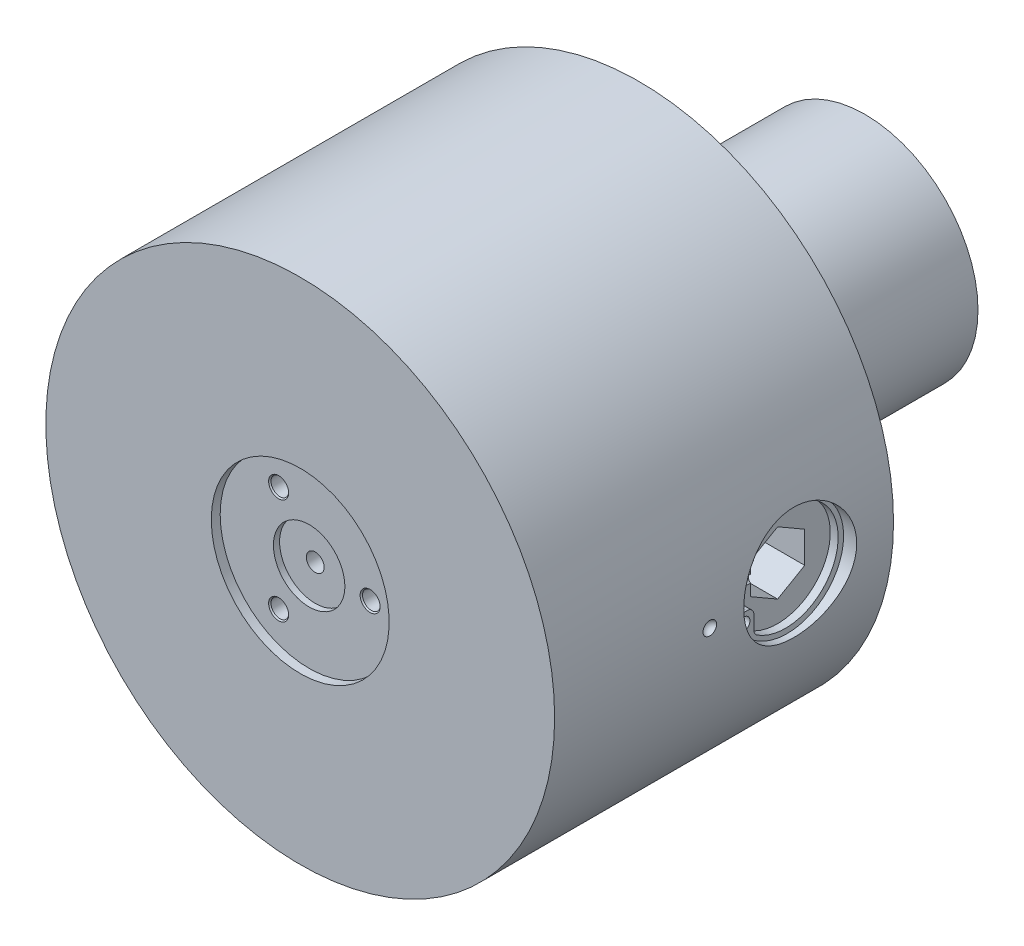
ISO-10303-21;
HEADER;
FILE_DESCRIPTION(('STEP AP214'),'2;1');
FILE_NAME('part.step','',(''),(''),'','','');
FILE_SCHEMA(('AUTOMOTIVE_DESIGN { 1 0 10303 214 1 1 1 1 }'));
ENDSEC;
DATA;
#1=APPLICATION_CONTEXT('core data for automotive mechanical design processes');
#2=APPLICATION_PROTOCOL_DEFINITION('international standard','automotive_design',2000,#1);
#3=PRODUCT_CONTEXT('',#1,'mechanical');
#4=PRODUCT('Part','Part','',(#3));
#5=PRODUCT_RELATED_PRODUCT_CATEGORY('part','',(#4));
#6=PRODUCT_DEFINITION_FORMATION('','',#4);
#7=PRODUCT_DEFINITION_CONTEXT('part definition',#1,'design');
#8=PRODUCT_DEFINITION('design','',#6,#7);
#9=PRODUCT_DEFINITION_SHAPE('','',#8);
#10=(LENGTH_UNIT() NAMED_UNIT(*) SI_UNIT(.MILLI.,.METRE.));
#11=(NAMED_UNIT(*) PLANE_ANGLE_UNIT() SI_UNIT($,.RADIAN.));
#12=(NAMED_UNIT(*) SI_UNIT($,.STERADIAN.) SOLID_ANGLE_UNIT());
#13=UNCERTAINTY_MEASURE_WITH_UNIT(LENGTH_MEASURE(1.E-05),#10,'distance_accuracy_value','');
#14=(GEOMETRIC_REPRESENTATION_CONTEXT(3) GLOBAL_UNCERTAINTY_ASSIGNED_CONTEXT((#13)) GLOBAL_UNIT_ASSIGNED_CONTEXT((#10,
#11,#12)) REPRESENTATION_CONTEXT('',''));
#15=CARTESIAN_POINT('',(0.,0.,0.));
#16=DIRECTION('',(0.,0.,1.));
#17=DIRECTION('',(1.,0.,0.));
#18=AXIS2_PLACEMENT_3D('',#15,#16,#17);
#19=CARTESIAN_POINT('',(0.,0.,32.2580000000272));
#20=DIRECTION('',(0.,0.,-1.));
#21=DIRECTION('',(1.,0.,0.));
#22=AXIS2_PLACEMENT_3D('',#19,#20,#21);
#23=CONICAL_SURFACE('',#22,7.74347222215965,1.04612731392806);
#24=CARTESIAN_POINT('',(-3.43724572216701,-6.93916822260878,32.2577999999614));
#25=CARTESIAN_POINT('',(-3.37951135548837,-6.93968665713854,32.272365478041));
#26=CARTESIAN_POINT('',(-3.32241932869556,-6.9351222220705,32.2890948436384));
#27=CARTESIAN_POINT('',(-3.21123217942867,-6.91680657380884,32.3261335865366));
#28=CARTESIAN_POINT('',(-3.15712371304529,-6.90310059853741,32.3464249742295));
#29=CARTESIAN_POINT('',(-3.05314340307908,-6.8675094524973,32.3899446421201));
#30=CARTESIAN_POINT('',(-3.00326186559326,-6.84564365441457,32.4131658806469));
#31=CARTESIAN_POINT('',(-2.90850959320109,-6.79476292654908,32.4619939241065));
#32=CARTESIAN_POINT('',(-2.86364517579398,-6.76573912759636,32.4876036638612));
#33=CARTESIAN_POINT('',(-2.77579469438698,-6.69858325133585,32.5431031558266));
#34=CARTESIAN_POINT('',(-2.7333780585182,-6.65985271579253,32.5731691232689));
#35=CARTESIAN_POINT('',(-2.65620516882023,-6.57640008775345,32.6347477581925));
#36=CARTESIAN_POINT('',(-2.62145070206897,-6.53167660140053,32.6662607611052));
#37=CARTESIAN_POINT('',(-2.55696042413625,-6.43255232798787,32.733385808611));
#38=CARTESIAN_POINT('',(-2.52811553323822,-6.37762905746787,32.7690846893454));
#39=CARTESIAN_POINT('',(-2.48100442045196,-6.26343033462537,32.8405768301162));
#40=CARTESIAN_POINT('',(-2.46274546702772,-6.2041519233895,32.8763701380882));
#41=CARTESIAN_POINT('',(-2.43679116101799,-6.0797527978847,32.948812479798));
#42=CARTESIAN_POINT('',(-2.42965616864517,-6.01448814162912,32.9854177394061));
#43=CARTESIAN_POINT('',(-2.42843121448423,-5.88261217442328,33.056348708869));
#44=CARTESIAN_POINT('',(-2.43432942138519,-5.81600213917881,33.0906764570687));
#45=CARTESIAN_POINT('',(-2.45728100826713,-5.6970259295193,33.1488343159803));
#46=CARTESIAN_POINT('',(-2.47181853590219,-5.644521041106,33.173378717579));
#47=CARTESIAN_POINT('',(-2.5099377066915,-5.54127285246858,33.218991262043));
#48=CARTESIAN_POINT('',(-2.53351591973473,-5.49052889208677,33.2400607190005));
#49=CARTESIAN_POINT('',(-2.59003860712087,-5.39203465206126,33.2777030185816));
#50=CARTESIAN_POINT('',(-2.62305816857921,-5.34431227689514,33.294237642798));
#51=CARTESIAN_POINT('',(-2.69793088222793,-5.25440572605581,33.3212965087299));
#52=CARTESIAN_POINT('',(-2.7397730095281,-5.21221474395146,33.3318281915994));
#53=CARTESIAN_POINT('',(-2.82434304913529,-5.14108715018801,33.3448744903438));
#54=CARTESIAN_POINT('',(-2.8660580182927,-5.11111535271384,33.3483319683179));
#55=CARTESIAN_POINT('',(-2.95366344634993,-5.05790975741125,33.349872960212));
#56=CARTESIAN_POINT('',(-2.99955174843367,-5.0346725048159,33.3479592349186));
#57=CARTESIAN_POINT('',(-3.08977781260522,-4.99733963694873,33.3393139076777));
#58=CARTESIAN_POINT('',(-3.13390479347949,-4.9826258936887,33.3330146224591));
#59=CARTESIAN_POINT('',(-3.22305757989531,-4.95955508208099,33.3164684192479));
#60=CARTESIAN_POINT('',(-3.26808349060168,-4.95119876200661,33.3062210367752));
#61=CARTESIAN_POINT('',(-3.36011911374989,-4.94045000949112,33.2817450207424));
#62=CARTESIAN_POINT('',(-3.40711900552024,-4.9383668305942,33.2673472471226));
#63=CARTESIAN_POINT('',(-3.49990034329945,-4.94063842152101,33.235500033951));
#64=CARTESIAN_POINT('',(-3.54568125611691,-4.9449959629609,33.2180492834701));
#65=CARTESIAN_POINT('',(-3.6414736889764,-4.96067016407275,33.1781617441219));
#66=CARTESIAN_POINT('',(-3.69119202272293,-4.97286771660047,33.1553691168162));
#67=CARTESIAN_POINT('',(-3.78722810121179,-5.00420064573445,33.1075205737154));
#68=CARTESIAN_POINT('',(-3.83354385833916,-5.02334003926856,33.0824633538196));
#69=CARTESIAN_POINT('',(-3.92927855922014,-5.07142777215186,33.026631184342));
#70=CARTESIAN_POINT('',(-3.97799673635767,-5.10145918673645,32.9955851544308));
#71=CARTESIAN_POINT('',(-4.06917799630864,-5.16888323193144,32.9323186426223));
#72=CARTESIAN_POINT('',(-4.1116375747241,-5.2062799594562,32.9000975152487));
#73=CARTESIAN_POINT('',(-4.19413816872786,-5.29227351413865,32.8314391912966));
#74=CARTESIAN_POINT('',(-4.23330788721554,-5.34167022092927,32.7949517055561));
#75=CARTESIAN_POINT('',(-4.3018519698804,-5.44717705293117,32.7224468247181));
#76=CARTESIAN_POINT('',(-4.33122343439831,-5.50328915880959,32.6864295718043));
#77=CARTESIAN_POINT('',(-4.37976199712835,-5.62248777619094,32.6147911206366));
#78=CARTESIAN_POINT('',(-4.39861671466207,-5.68572674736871,32.5792099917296));
#79=CARTESIAN_POINT('',(-4.42360113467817,-5.81605023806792,32.5105588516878));
#80=CARTESIAN_POINT('',(-4.42972805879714,-5.88313559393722,32.4774893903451));
#81=CARTESIAN_POINT('',(-4.42818377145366,-6.01452344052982,32.417018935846));
#82=CARTESIAN_POINT('',(-4.42136779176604,-6.07873047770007,32.3893909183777));
#83=CARTESIAN_POINT('',(-4.39490135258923,-6.20609999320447,32.3384284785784));
#84=CARTESIAN_POINT('',(-4.37529324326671,-6.26926521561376,32.3150802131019));
#85=CARTESIAN_POINT('',(-4.34086725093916,-6.3502540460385,32.2877285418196));
#86=CARTESIAN_POINT('',(-4.33179211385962,-6.36982575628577,32.2813291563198));
#87=CARTESIAN_POINT('',(-4.31232114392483,-6.40846724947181,32.2691189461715));
#88=CARTESIAN_POINT('',(-4.30192643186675,-6.42753744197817,32.2633076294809));
#89=CARTESIAN_POINT('',(-4.29087310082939,-6.44632622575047,32.2577999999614));
#90=B_SPLINE_CURVE_WITH_KNOTS('',3,(#24,#25,#26,#27,#28,#29,#30,#31,#32,#33,#34,#35,#36,#37,#38,
#39,#40,#41,#42,#43,#44,#45,#46,#47,#48,#49,#50,#51,#52,#53,#54,#55,#56,#57,#58,#59,#60,#61,#62,
#63,#64,#65,#66,#67,#68,#69,#70,#71,#72,#73,#74,#75,#76,#77,#78,#79,#80,#81,#82,#83,#84,#85,#86,
#87,#88,#89),.UNSPECIFIED.,.F.,.F.,(4,2,2,2,2,2,2,2,2,2,2,2,2,2,2,2,2,2,2,2,2,2,2,2,2,2,2,2,2,2,
2,2,4),(0.,0.178186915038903,0.355498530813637,0.532391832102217,0.709505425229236,
0.903206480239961,1.09695266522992,1.31073874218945,1.52467143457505,1.749067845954,
1.97326063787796,2.15180511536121,2.33028191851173,2.5102196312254,2.689933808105,
2.84352361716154,2.9970344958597,3.13722937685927,3.2774407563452,3.4244596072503,
3.57154174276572,3.7390111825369,3.90657768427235,4.10111996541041,4.29577076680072,
4.51330729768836,4.73090814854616,4.95466845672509,5.1784776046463,5.38801030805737,
5.59685281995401,5.6643208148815,5.73173188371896),.UNSPECIFIED.);
#91=CARTESIAN_POINT('',(-3.43645460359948,-6.93917443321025,32.2579999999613));
#92=VERTEX_POINT('',#91);
#93=CARTESIAN_POINT('',(-2.929,-5.07317681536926,33.3492700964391));
#94=VERTEX_POINT('',#93);
#95=EDGE_CURVE('E255',#92,#94,#90,.T.);
#96=ORIENTED_EDGE('',*,*,#95,.T.);
#97=CARTESIAN_POINT('',(0.,0.,33.3492700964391));
#98=DIRECTION('',(0.,0.,-1.));
#99=DIRECTION('',(-1.,0.,0.));
#100=AXIS2_PLACEMENT_3D('',#97,#98,#99);
#101=CIRCLE('',#100,5.858);
#102=CARTESIAN_POINT('',(5.858,0.,33.3492700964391));
#103=VERTEX_POINT('',#102);
#104=EDGE_CURVE('E37',#94,#103,#101,.F.);
#105=ORIENTED_EDGE('',*,*,#104,.T.);
#106=CARTESIAN_POINT('',(7.72811882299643,0.492841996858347,32.2577999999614));
#107=CARTESIAN_POINT('',(7.69970061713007,0.543100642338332,32.272365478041));
#108=CARTESIAN_POINT('',(7.66720168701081,0.590261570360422,32.2890948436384));
#109=CARTESIAN_POINT('',(7.59574629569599,0.677394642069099,32.3261335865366));
#110=CARTESIAN_POINT('',(7.55682233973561,0.717400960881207,32.3464249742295));
#111=CARTESIAN_POINT('',(7.47400934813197,0.789654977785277,32.3899446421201));
#112=CARTESIAN_POINT('',(7.43013224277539,0.821920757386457,32.4131658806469));
#113=CARTESIAN_POINT('',(7.33869210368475,0.878538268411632,32.4619939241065));
#114=CARTESIAN_POINT('',(7.29112454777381,0.902880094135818,32.4876036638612));
#115=CARTESIAN_POINT('',(7.1890406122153,0.945382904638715,32.5431031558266));
#116=CARTESIAN_POINT('',(7.13429066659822,0.9627515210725,32.5731691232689));
#117=CARTESIAN_POINT('',(7.02343212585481,0.987858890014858,32.6347477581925));
#118=CARTESIAN_POINT('',(6.96732321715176,0.995595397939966,32.6662607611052));
#119=CARTESIAN_POINT('',(6.84923393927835,1.00188348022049,32.733385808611));
#120=CARTESIAN_POINT('',(6.78724654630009,0.999402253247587,32.7690846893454));
#121=CARTESIAN_POINT('',(6.66479199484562,0.98310231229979,32.8405768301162));
#122=CARTESIAN_POINT('',(6.60432590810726,0.969275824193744,32.8763701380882));
#123=CARTESIAN_POINT('',(6.48361595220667,0.929553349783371,32.948812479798));
#124=CARTESIAN_POINT('',(6.42352760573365,0.903100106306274,32.9854177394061));
#125=CARTESIAN_POINT('',(6.30870719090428,0.838222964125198,33.056348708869));
#126=CARTESIAN_POINT('',(6.25397031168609,0.799809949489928,33.0906764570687));
#127=CARTESIAN_POINT('',(6.16240968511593,0.72044518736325,33.1488343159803));
#128=CARTESIAN_POINT('',(6.12420788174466,0.681602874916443,33.173378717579));
#129=CARTESIAN_POINT('',(6.0538519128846,0.596966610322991,33.218991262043));
#130=CARTESIAN_POINT('',(6.02169546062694,0.551175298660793,33.2400607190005));
#131=CARTESIAN_POINT('',(5.96465829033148,0.452978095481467,33.2777030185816));
#132=CARTESIAN_POINT('',(5.93983928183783,0.400521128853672,33.2942376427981));
#133=CARTESIAN_POINT('',(5.8994142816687,0.290726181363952,33.3212965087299));
#134=CARTESIAN_POINT('',(5.88379688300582,0.233394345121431,33.3318281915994));
#135=CARTESIAN_POINT('',(5.86448359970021,0.124590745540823,33.3448744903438));
#136=CARTESIAN_POINT('',(5.85938474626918,0.0734786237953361,33.3483319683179));
#137=CARTESIAN_POINT('',(5.85711006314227,-0.0289927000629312,33.349872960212));
#138=CARTESIAN_POINT('',(5.85993016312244,-0.0803517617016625,33.3479592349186));
#139=CARTESIAN_POINT('',(5.87271198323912,-0.177156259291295,33.3393139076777));
#140=CARTESIAN_POINT('',(5.88203299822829,-0.222728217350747,33.3330146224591));
#141=CARTESIAN_POINT('',(5.906629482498,-0.311472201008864,33.3164684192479));
#142=CARTESIAN_POINT('',(5.92190565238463,-0.354643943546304,33.3062210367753));
#143=CARTESIAN_POINT('',(5.95861477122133,-0.439723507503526,33.2817450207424));
#144=CARTESIAN_POINT('',(5.98031063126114,-0.481468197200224,33.2673472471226));
#145=CARTESIAN_POINT('',(6.02866855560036,-0.560683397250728,33.235500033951));
#146=CARTESIAN_POINT('',(6.05533275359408,-0.598152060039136,33.2180492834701));
#147=CARTESIAN_POINT('',(6.11680322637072,-0.673273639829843,33.1781617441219));
#148=CARTESIAN_POINT('',(6.15222578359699,-0.710232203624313,33.1553691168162));
#149=CARTESIAN_POINT('',(6.22737893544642,-0.777735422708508,33.1075205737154));
#150=CARTESIAN_POINT('',(6.26711201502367,-0.808276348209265,33.0824633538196));
#151=CARTESIAN_POINT('',(6.3566245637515,-0.867141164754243,33.026631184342));
#152=CARTESIAN_POINT('',(6.4069916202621,-0.89431663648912,32.9955851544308));
#153=CARTESIAN_POINT('',(6.51097318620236,-0.939569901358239,32.9323186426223));
#154=CARTESIAN_POINT('',(6.56458949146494,-0.957642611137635,32.9000975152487));
#155=CARTESIAN_POINT('',(6.68031239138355,-0.986093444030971,32.8314391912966));
#156=CARTESIAN_POINT('',(6.74267605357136,-0.995317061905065,32.7949517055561));
#157=CARTESIAN_POINT('',(6.86831969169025,-1.00192456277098,32.7224468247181));
#158=CARTESIAN_POINT('',(6.93159993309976,-0.999304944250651,32.6864295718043));
#159=CARTESIAN_POINT('',(7.059098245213,-0.981741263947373,32.6147911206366));
#160=CARTESIAN_POINT('',(7.123292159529,-0.966450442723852,32.5792099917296));
#161=CARTESIAN_POINT('',(7.24864782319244,-0.922925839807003,32.5105588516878));
#162=CARTESIAN_POINT('',(7.30980890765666,-0.894689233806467,32.4774893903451));
#163=CARTESIAN_POINT('',(7.42282197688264,-0.827657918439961,32.417018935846));
#164=CARTESIAN_POINT('',(7.47501891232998,-0.789651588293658,32.3893909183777));
#165=CARTESIAN_POINT('',(7.57209092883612,-0.703046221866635,32.3384284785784));
#166=CARTESIAN_POINT('',(7.61698956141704,-0.654482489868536,32.3150802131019));
#167=CARTESIAN_POINT('',(7.66991494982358,-0.584174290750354,32.2877285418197));
#168=CARTESIAN_POINT('',(7.68232697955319,-0.566529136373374,32.2813291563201));
#169=CARTESIAN_POINT('',(7.70605600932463,-0.530346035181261,32.269118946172));
#170=CARTESIAN_POINT('',(7.71737392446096,-0.511808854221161,32.2633076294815));
#171=CARTESIAN_POINT('',(7.72811882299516,-0.492841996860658,32.2577999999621));
#172=B_SPLINE_CURVE_WITH_KNOTS('',3,(#106,#107,#108,#109,#110,#111,#112,#113,#114,#115,#116,
#117,#118,#119,#120,#121,#122,#123,#124,#125,#126,#127,#128,#129,#130,#131,#132,#133,#134,#135,
#136,#137,#138,#139,#140,#141,#142,#143,#144,#145,#146,#147,#148,#149,#150,#151,#152,#153,#154,
#155,#156,#157,#158,#159,#160,#161,#162,#163,#164,#165,#166,#167,#168,#169,#170,#171),
.UNSPECIFIED.,.F.,.F.,(4,2,2,2,2,2,2,2,2,2,2,2,2,2,2,2,2,2,2,2,2,2,2,2,2,2,2,2,2,2,2,2,4),(0.,
0.178186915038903,0.355498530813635,0.532391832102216,0.709505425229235,0.90320648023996,
1.09695266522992,1.31073874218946,1.52467143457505,1.74906784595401,1.97326063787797,
2.15180511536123,2.33028191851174,2.51021963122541,2.68993380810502,2.84352361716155,
2.99703449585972,3.13722937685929,3.27744075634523,3.42445960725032,3.57154174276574,
3.73901118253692,3.90657768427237,4.10111996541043,4.29577076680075,4.51330729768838,
4.73090814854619,4.95466845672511,5.17847760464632,5.3880103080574,5.59685281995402,
5.66432081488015,5.73173188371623),.UNSPECIFIED.);
#173=CARTESIAN_POINT('',(7.7277286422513,-0.493530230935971,32.2579999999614));
#174=VERTEX_POINT('',#173);
#175=EDGE_CURVE('E295',#103,#174,#172,.T.);
#176=ORIENTED_EDGE('',*,*,#175,.T.);
#177=CARTESIAN_POINT('',(0.,0.,32.2579999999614));
#178=DIRECTION('',(0.,0.,-1.));
#179=DIRECTION('',(1.,0.,0.));
#180=AXIS2_PLACEMENT_3D('',#177,#178,#179);
#181=CIRCLE('',#180,7.74347222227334);
#182=EDGE_CURVE('E650',#92,#174,#181,.F.);
#183=ORIENTED_EDGE('',*,*,#182,.F.);
#184=EDGE_LOOP('',(#96,#105,#176,#183));
#185=FACE_BOUND('',#184,.T.);
#186=ADVANCED_FACE('F14',(#185),#23,.F.);
#187=CARTESIAN_POINT('',(7.72772864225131,0.493530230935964,32.2579999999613));
#188=VERTEX_POINT('',#187);
#189=EDGE_CURVE('E287',#188,#103,#172,.T.);
#190=ORIENTED_EDGE('',*,*,#189,.T.);
#191=CARTESIAN_POINT('',(-2.929,5.07317681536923,33.3492700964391));
#192=VERTEX_POINT('',#191);
#193=EDGE_CURVE('E1127',#103,#192,#101,.F.);
#194=ORIENTED_EDGE('',*,*,#193,.T.);
#195=CARTESIAN_POINT('',(-4.29087310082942,6.4463262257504,32.2577999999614));
#196=CARTESIAN_POINT('',(-4.32018926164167,6.39658601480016,32.272365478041));
#197=CARTESIAN_POINT('',(-4.34478235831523,6.34486065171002,32.2890948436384));
#198=CARTESIAN_POINT('',(-4.38451411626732,6.23941193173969,32.3261335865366));
#199=CARTESIAN_POINT('',(-4.39969862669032,6.18569963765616,32.3464249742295));
#200=CARTESIAN_POINT('',(-4.42086594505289,6.07785447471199,32.3899446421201));
#201=CARTESIAN_POINT('',(-4.42687037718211,6.02372289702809,32.4131658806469));
#202=CARTESIAN_POINT('',(-4.43018251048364,5.91622465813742,32.4619939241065));
#203=CARTESIAN_POINT('',(-4.42747937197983,5.86285903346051,32.4876036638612));
#204=CARTESIAN_POINT('',(-4.41324591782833,5.7532003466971,32.5431031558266));
#205=CARTESIAN_POINT('',(-4.40091260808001,5.69710119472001,32.5731691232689));
#206=CARTESIAN_POINT('',(-4.36722695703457,5.58854119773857,32.6347477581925));
#207=CARTESIAN_POINT('',(-4.34587251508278,5.53608120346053,32.6662607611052));
#208=CARTESIAN_POINT('',(-4.29227351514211,5.43066884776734,32.733385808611));
#209=CARTESIAN_POINT('',(-4.25913101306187,5.37822680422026,32.7690846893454));
#210=CARTESIAN_POINT('',(-4.18378757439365,5.28032802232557,32.8405768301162));
#211=CARTESIAN_POINT('',(-4.14158044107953,5.23487609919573,32.8763701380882));
#212=CARTESIAN_POINT('',(-4.04682479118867,5.1501994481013,32.948812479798));
#213=CARTESIAN_POINT('',(-3.9938714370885,5.11138803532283,32.9854177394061));
#214=CARTESIAN_POINT('',(-3.88027597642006,5.04438921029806,33.056348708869));
#215=CARTESIAN_POINT('',(-3.81964089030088,5.01619218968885,33.0906764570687));
#216=CARTESIAN_POINT('',(-3.70512867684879,4.97658074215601,33.1488343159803));
#217=CARTESIAN_POINT('',(-3.65238934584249,4.96291816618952,33.173378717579));
#218=CARTESIAN_POINT('',(-3.54391420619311,4.94430624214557,33.218991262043));
#219=CARTESIAN_POINT('',(-3.48817954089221,4.93935359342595,33.2400607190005));
#220=CARTESIAN_POINT('',(-3.3746196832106,4.93905655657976,33.2777030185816));
#221=CARTESIAN_POINT('',(-3.31678111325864,4.94379114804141,33.2942376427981));
#222=CARTESIAN_POINT('',(-3.20148339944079,4.96367954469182,33.3212965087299));
#223=CARTESIAN_POINT('',(-3.14402387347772,4.97882039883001,33.3318281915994));
#224=CARTESIAN_POINT('',(-3.04014055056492,5.01649640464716,33.3448744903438));
#225=CARTESIAN_POINT('',(-2.99332672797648,5.03763672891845,33.3483319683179));
#226=CARTESIAN_POINT('',(-2.90344661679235,5.08690245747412,33.3498729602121));
#227=CARTESIAN_POINT('',(-2.86037841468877,5.11502426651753,33.3479592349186));
#228=CARTESIAN_POINT('',(-2.78293417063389,5.17449589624,33.3393139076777));
#229=CARTESIAN_POINT('',(-2.74812820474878,5.20535411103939,33.3330146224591));
#230=CARTESIAN_POINT('',(-2.68357190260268,5.27102728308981,33.3164684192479));
#231=CARTESIAN_POINT('',(-2.65382216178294,5.30584270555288,33.3062210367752));
#232=CARTESIAN_POINT('',(-2.59849565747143,5.38017351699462,33.2817450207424));
#233=CARTESIAN_POINT('',(-2.57319162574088,5.41983502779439,33.2673472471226));
#234=CARTESIAN_POINT('',(-2.52876821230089,5.50132181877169,33.235500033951));
#235=CARTESIAN_POINT('',(-2.50965149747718,5.543148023,33.2180492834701));
#236=CARTESIAN_POINT('',(-2.47532953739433,5.63394380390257,33.1781617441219));
#237=CARTESIAN_POINT('',(-2.46103376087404,5.68309992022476,33.1553691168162));
#238=CARTESIAN_POINT('',(-2.44015083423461,5.78193606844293,33.1075205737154));
#239=CARTESIAN_POINT('',(-2.43356815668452,5.8316163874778,33.0824633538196));
#240=CARTESIAN_POINT('',(-2.42734600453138,5.93856893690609,33.026631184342));
#241=CARTESIAN_POINT('',(-2.42899488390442,5.99577582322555,32.9955851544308));
#242=CARTESIAN_POINT('',(-2.4417951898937,6.10845313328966,32.9323186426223));
#243=CARTESIAN_POINT('',(-2.45295191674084,6.16392257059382,32.9000975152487));
#244=CARTESIAN_POINT('',(-2.48617422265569,6.2783669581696,32.8314391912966));
#245=CARTESIAN_POINT('',(-2.50936816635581,6.33698728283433,32.7949517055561));
#246=CARTESIAN_POINT('',(-2.56646772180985,6.44910161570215,32.7224468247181));
#247=CARTESIAN_POINT('',(-2.60037649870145,6.50259410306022,32.6864295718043));
#248=CARTESIAN_POINT('',(-2.67933624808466,6.60422904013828,32.6147911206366));
#249=CARTESIAN_POINT('',(-2.72467544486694,6.65217719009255,32.5792099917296));
#250=CARTESIAN_POINT('',(-2.82504668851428,6.73897607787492,32.5105588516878));
#251=CARTESIAN_POINT('',(-2.88008084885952,6.77782482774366,32.4774893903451));
#252=CARTESIAN_POINT('',(-2.99463820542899,6.84218135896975,32.417018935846));
#253=CARTESIAN_POINT('',(-3.05365112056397,6.86838206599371,32.3893909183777));
#254=CARTESIAN_POINT('',(-3.1771895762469,6.90914621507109,32.3384284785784));
#255=CARTESIAN_POINT('',(-3.2416963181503,6.92374770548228,32.3150802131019));
#256=CARTESIAN_POINT('',(-3.32904769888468,6.93442833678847,32.2877285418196));
#257=CARTESIAN_POINT('',(-3.35053486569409,6.93635489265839,32.2813291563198));
#258=CARTESIAN_POINT('',(-3.39373486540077,6.93881328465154,32.2691189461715));
#259=CARTESIAN_POINT('',(-3.41544749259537,6.9393462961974,32.2633076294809));
#260=CARTESIAN_POINT('',(-3.43724572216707,6.93916822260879,32.2577999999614));
#261=B_SPLINE_CURVE_WITH_KNOTS('',3,(#195,#196,#197,#198,#199,#200,#201,#202,#203,#204,#205,
#206,#207,#208,#209,#210,#211,#212,#213,#214,#215,#216,#217,#218,#219,#220,#221,#222,#223,#224,
#225,#226,#227,#228,#229,#230,#231,#232,#233,#234,#235,#236,#237,#238,#239,#240,#241,#242,#243,
#244,#245,#246,#247,#248,#249,#250,#251,#252,#253,#254,#255,#256,#257,#258,#259,#260),
.UNSPECIFIED.,.F.,.F.,(4,2,2,2,2,2,2,2,2,2,2,2,2,2,2,2,2,2,2,2,2,2,2,2,2,2,2,2,2,2,2,2,4),(0.,
0.1781869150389,0.355498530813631,0.532391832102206,0.709505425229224,0.903206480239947,
1.0969526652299,1.31073874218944,1.52467143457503,1.74906784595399,1.97326063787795,
2.15180511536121,2.33028191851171,2.51021963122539,2.68993380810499,2.84352361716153,
2.9970344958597,3.13722937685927,3.27744075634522,3.42445960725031,3.57154174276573,
3.73901118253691,3.90657768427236,4.10111996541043,4.29577076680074,4.51330729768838,
4.73090814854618,4.95466845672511,5.17847760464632,5.38801030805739,5.59685281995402,
5.66432081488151,5.73173188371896),.UNSPECIFIED.);
#262=CARTESIAN_POINT('',(-3.43645460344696,6.93917443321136,32.258));
#263=VERTEX_POINT('',#262);
#264=EDGE_CURVE('E307',#192,#263,#261,.T.);
#265=ORIENTED_EDGE('',*,*,#264,.T.);
#266=EDGE_CURVE('E652',#188,#263,#181,.F.);
#267=ORIENTED_EDGE('',*,*,#266,.F.);
#268=EDGE_LOOP('',(#190,#194,#265,#267));
#269=FACE_BOUND('',#268,.T.);
#270=ADVANCED_FACE('F387',(#269),#23,.F.);
#271=CARTESIAN_POINT('',(19.967,27.6098,10.4901999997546));
#272=DIRECTION('',(1.,0.,0.));
#273=DIRECTION('',(0.,1.,0.));
#274=AXIS2_PLACEMENT_3D('',#271,#272,#273);
#275=PLANE('',#274);
#276=DIRECTION('',(0.,-1.,0.));
#277=VECTOR('',#276,1.);
#278=CARTESIAN_POINT('',(19.967,1.75976362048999,13.5381999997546));
#279=LINE('',#278,#277);
#280=CARTESIAN_POINT('',(19.967,1.75976362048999,13.5381999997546));
#281=VERTEX_POINT('',#280);
#282=CARTESIAN_POINT('',(19.967,-1.75976362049,13.5381999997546));
#283=VERTEX_POINT('',#282);
#284=EDGE_CURVE('E234',#281,#283,#279,.T.);
#285=ORIENTED_EDGE('',*,*,#284,.T.);
#286=DIRECTION('',(0.,-0.5,-0.866025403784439));
#287=VECTOR('',#286,1.);
#288=CARTESIAN_POINT('',(19.967,-1.75976362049,13.5381999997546));
#289=LINE('',#288,#287);
#290=CARTESIAN_POINT('',(19.967,-3.51952724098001,10.4901999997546));
#291=VERTEX_POINT('',#290);
#292=EDGE_CURVE('E238',#283,#291,#289,.T.);
#293=ORIENTED_EDGE('',*,*,#292,.T.);
#294=DIRECTION('',(0.,0.5,-0.866025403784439));
#295=VECTOR('',#294,1.);
#296=CARTESIAN_POINT('',(19.967,-3.51952724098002,10.4901999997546));
#297=LINE('',#296,#295);
#298=CARTESIAN_POINT('',(19.967,-1.75976362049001,7.4421999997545));
#299=VERTEX_POINT('',#298);
#300=EDGE_CURVE('E240',#291,#299,#297,.T.);
#301=ORIENTED_EDGE('',*,*,#300,.T.);
#302=DIRECTION('',(0.,1.,0.));
#303=VECTOR('',#302,1.);
#304=CARTESIAN_POINT('',(19.967,-1.75976362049,7.4421999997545));
#305=LINE('',#304,#303);
#306=CARTESIAN_POINT('',(19.967,1.75976362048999,7.4421999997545));
#307=VERTEX_POINT('',#306);
#308=EDGE_CURVE('E220',#299,#307,#305,.T.);
#309=ORIENTED_EDGE('',*,*,#308,.T.);
#310=DIRECTION('',(0.,0.5,0.866025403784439));
#311=VECTOR('',#310,1.);
#312=CARTESIAN_POINT('',(19.967,1.75976362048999,7.4421999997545));
#313=LINE('',#312,#311);
#314=CARTESIAN_POINT('',(19.967,3.51952724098,10.4901999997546));
#315=VERTEX_POINT('',#314);
#316=EDGE_CURVE('E226',#307,#315,#313,.T.);
#317=ORIENTED_EDGE('',*,*,#316,.T.);
#318=DIRECTION('',(0.,-0.5,0.866025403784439));
#319=VECTOR('',#318,1.);
#320=CARTESIAN_POINT('',(19.967,3.51952724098,10.4901999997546));
#321=LINE('',#320,#319);
#322=EDGE_CURVE('E230',#315,#281,#321,.T.);
#323=ORIENTED_EDGE('',*,*,#322,.T.);
#324=EDGE_LOOP('',(#285,#293,#301,#309,#317,#323));
#325=FACE_BOUND('',#324,.T.);
#326=ADVANCED_FACE('F278',(#325),#275,.T.);
#327=CARTESIAN_POINT('',(19.967,3.51952724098,10.4901999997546));
#328=DIRECTION('',(0.,0.866025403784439,0.5));
#329=DIRECTION('',(0.,-0.5,0.866025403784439));
#330=AXIS2_PLACEMENT_3D('',#327,#328,#329);
#331=PLANE('',#330);
#332=DIRECTION('',(0.,0.5,-0.866025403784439));
#333=VECTOR('',#332,1.);
#334=CARTESIAN_POINT('',(26.063,1.75976362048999,13.5381999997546));
#335=LINE('',#334,#333);
#336=CARTESIAN_POINT('',(26.063,1.75976362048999,13.5381999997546));
#337=VERTEX_POINT('',#336);
#338=CARTESIAN_POINT('',(26.063,3.51952724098,10.4901999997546));
#339=VERTEX_POINT('',#338);
#340=EDGE_CURVE('E208',#337,#339,#335,.T.);
#341=ORIENTED_EDGE('',*,*,#340,.F.);
#342=DIRECTION('',(1.,0.,0.));
#343=VECTOR('',#342,1.);
#344=CARTESIAN_POINT('',(19.967,1.75976362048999,13.5381999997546));
#345=LINE('',#344,#343);
#346=EDGE_CURVE('E228',#281,#337,#345,.T.);
#347=ORIENTED_EDGE('',*,*,#346,.F.);
#348=ORIENTED_EDGE('',*,*,#322,.F.);
#349=DIRECTION('',(1.,0.,0.));
#350=VECTOR('',#349,1.);
#351=CARTESIAN_POINT('',(19.967,3.51952724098,10.4901999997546));
#352=LINE('',#351,#350);
#353=EDGE_CURVE('E224',#315,#339,#352,.T.);
#354=ORIENTED_EDGE('',*,*,#353,.T.);
#355=EDGE_LOOP('',(#341,#347,#348,#354));
#356=FACE_BOUND('',#355,.T.);
#357=ADVANCED_FACE('F558',(#356),#331,.F.);
#358=CARTESIAN_POINT('',(19.967,1.75976362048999,13.5381999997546));
#359=DIRECTION('',(0.,0.,1.));
#360=DIRECTION('',(0.,-1.,0.));
#361=AXIS2_PLACEMENT_3D('',#358,#359,#360);
#362=PLANE('',#361);
#363=DIRECTION('',(0.,1.,0.));
#364=VECTOR('',#363,1.);
#365=CARTESIAN_POINT('',(26.063,0.,13.5381999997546));
#366=LINE('',#365,#364);
#367=CARTESIAN_POINT('',(26.063,0.43067853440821,13.5381999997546));
#368=VERTEX_POINT('',#367);
#369=EDGE_CURVE('E201',#368,#337,#366,.T.);
#370=ORIENTED_EDGE('',*,*,#369,.F.);
#371=CARTESIAN_POINT('',(26.317,0.,13.5381999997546));
#372=DIRECTION('',(0.,0.,-1.));
#373=DIRECTION('',(-1.,0.,0.));
#374=AXIS2_PLACEMENT_3D('',#371,#372,#373);
#375=CIRCLE('',#374,0.5);
#376=CARTESIAN_POINT('',(26.063,-0.430678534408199,13.5381999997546));
#377=VERTEX_POINT('',#376);
#378=EDGE_CURVE('E29',#377,#368,#375,.T.);
#379=ORIENTED_EDGE('',*,*,#378,.F.);
#380=CARTESIAN_POINT('',(26.063,-1.75976362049,13.5381999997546));
#381=VERTEX_POINT('',#380);
#382=EDGE_CURVE('E198',#381,#377,#366,.T.);
#383=ORIENTED_EDGE('',*,*,#382,.F.);
#384=DIRECTION('',(1.,0.,0.));
#385=VECTOR('',#384,1.);
#386=CARTESIAN_POINT('',(19.967,-1.75976362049,13.5381999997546));
#387=LINE('',#386,#385);
#388=EDGE_CURVE('E232',#283,#381,#387,.T.);
#389=ORIENTED_EDGE('',*,*,#388,.F.);
#390=ORIENTED_EDGE('',*,*,#284,.F.);
#391=ORIENTED_EDGE('',*,*,#346,.T.);
#392=EDGE_LOOP('',(#370,#379,#383,#389,#390,#391));
#393=FACE_BOUND('',#392,.T.);
#394=ADVANCED_FACE('F196',(#393),#362,.F.);
#395=CARTESIAN_POINT('',(19.967,-1.75976362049,13.5381999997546));
#396=DIRECTION('',(0.,-0.866025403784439,0.5));
#397=DIRECTION('',(0.,-0.5,-0.866025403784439));
#398=AXIS2_PLACEMENT_3D('',#395,#396,#397);
#399=PLANE('',#398);
#400=DIRECTION('',(0.,0.5,0.866025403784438));
#401=VECTOR('',#400,1.);
#402=CARTESIAN_POINT('',(26.063,-3.51952724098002,10.4901999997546));
#403=LINE('',#402,#401);
#404=CARTESIAN_POINT('',(26.063,-3.51952724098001,10.4901999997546));
#405=VERTEX_POINT('',#404);
#406=EDGE_CURVE('E207',#405,#381,#403,.T.);
#407=ORIENTED_EDGE('',*,*,#406,.F.);
#408=DIRECTION('',(1.,0.,0.));
#409=VECTOR('',#408,1.);
#410=CARTESIAN_POINT('',(19.967,-3.51952724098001,10.4901999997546));
#411=LINE('',#410,#409);
#412=EDGE_CURVE('E236',#291,#405,#411,.T.);
#413=ORIENTED_EDGE('',*,*,#412,.F.);
#414=ORIENTED_EDGE('',*,*,#292,.F.);
#415=ORIENTED_EDGE('',*,*,#388,.T.);
#416=EDGE_LOOP('',(#407,#413,#414,#415));
#417=FACE_BOUND('',#416,.T.);
#418=ADVANCED_FACE('F554',(#417),#399,.F.);
#419=CARTESIAN_POINT('',(19.967,-3.51952724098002,10.4901999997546));
#420=DIRECTION('',(0.,-0.866025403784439,-0.5));
#421=DIRECTION('',(0.,0.5,-0.866025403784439));
#422=AXIS2_PLACEMENT_3D('',#419,#420,#421);
#423=PLANE('',#422);
#424=DIRECTION('',(1.,0.,0.));
#425=VECTOR('',#424,1.);
#426=CARTESIAN_POINT('',(19.967,-1.75976362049,7.4421999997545));
#427=LINE('',#426,#425);
#428=CARTESIAN_POINT('',(26.063,-1.75976362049,7.4421999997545));
#429=VERTEX_POINT('',#428);
#430=EDGE_CURVE('E222',#429,#299,#427,.F.);
#431=ORIENTED_EDGE('',*,*,#430,.T.);
#432=ORIENTED_EDGE('',*,*,#300,.F.);
#433=ORIENTED_EDGE('',*,*,#412,.T.);
#434=DIRECTION('',(0.,-0.5,0.866025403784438));
#435=VECTOR('',#434,1.);
#436=CARTESIAN_POINT('',(26.063,-1.75976362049,7.4421999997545));
#437=LINE('',#436,#435);
#438=EDGE_CURVE('E216',#429,#405,#437,.T.);
#439=ORIENTED_EDGE('',*,*,#438,.F.);
#440=EDGE_LOOP('',(#431,#432,#433,#439));
#441=FACE_BOUND('',#440,.T.);
#442=ADVANCED_FACE('F548',(#441),#423,.F.);
#443=CARTESIAN_POINT('',(19.967,-1.75976362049,7.4421999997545));
#444=DIRECTION('',(0.,0.,-1.));
#445=DIRECTION('',(0.,1.,0.));
#446=AXIS2_PLACEMENT_3D('',#443,#444,#445);
#447=PLANE('',#446);
#448=DIRECTION('',(0.,1.,0.));
#449=VECTOR('',#448,1.);
#450=CARTESIAN_POINT('',(26.063,0.,7.4421999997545));
#451=LINE('',#450,#449);
#452=CARTESIAN_POINT('',(26.063,1.75976362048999,7.4421999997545));
#453=VERTEX_POINT('',#452);
#454=EDGE_CURVE('E248',#453,#429,#451,.F.);
#455=ORIENTED_EDGE('',*,*,#454,.F.);
#456=DIRECTION('',(1.,0.,0.));
#457=VECTOR('',#456,1.);
#458=CARTESIAN_POINT('',(19.967,1.75976362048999,7.4421999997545));
#459=LINE('',#458,#457);
#460=EDGE_CURVE('E218',#307,#453,#459,.T.);
#461=ORIENTED_EDGE('',*,*,#460,.F.);
#462=ORIENTED_EDGE('',*,*,#308,.F.);
#463=ORIENTED_EDGE('',*,*,#430,.F.);
#464=EDGE_LOOP('',(#455,#461,#462,#463));
#465=FACE_BOUND('',#464,.T.);
#466=ADVANCED_FACE('F545',(#465),#447,.F.);
#467=CARTESIAN_POINT('',(19.967,1.75976362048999,7.4421999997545));
#468=DIRECTION('',(0.,0.866025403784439,-0.5));
#469=DIRECTION('',(0.,0.5,0.866025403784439));
#470=AXIS2_PLACEMENT_3D('',#467,#468,#469);
#471=PLANE('',#470);
#472=DIRECTION('',(0.,-0.5,-0.866025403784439));
#473=VECTOR('',#472,1.);
#474=CARTESIAN_POINT('',(26.063,3.51952724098,10.4901999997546));
#475=LINE('',#474,#473);
#476=EDGE_CURVE('E211',#339,#453,#475,.T.);
#477=ORIENTED_EDGE('',*,*,#476,.F.);
#478=ORIENTED_EDGE('',*,*,#353,.F.);
#479=ORIENTED_EDGE('',*,*,#316,.F.);
#480=ORIENTED_EDGE('',*,*,#460,.T.);
#481=EDGE_LOOP('',(#477,#478,#479,#480));
#482=FACE_BOUND('',#481,.T.);
#483=ADVANCED_FACE('F539',(#482),#471,.F.);
#484=CARTESIAN_POINT('',(26.063,0.,16.4845999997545));
#485=DIRECTION('',(1.,0.,0.));
#486=DIRECTION('',(0.,1.,0.));
#487=AXIS2_PLACEMENT_3D('',#484,#485,#486);
#488=PLANE('',#487);
#489=CARTESIAN_POINT('',(26.063,3.175,15.1892));
#490=DIRECTION('',(1.,0.,0.));
#491=DIRECTION('',(0.,1.,0.));
#492=AXIS2_PLACEMENT_3D('',#489,#490,#491);
#493=CIRCLE('',#492,0.6985);
#494=CARTESIAN_POINT('',(26.063,3.8735,15.1892));
#495=VERTEX_POINT('',#494);
#496=EDGE_CURVE('E244',#495,#495,#493,.T.);
#497=ORIENTED_EDGE('',*,*,#496,.T.);
#498=EDGE_LOOP('',(#497));
#499=FACE_BOUND('',#498,.T.);
#500=ADVANCED_FACE('F383',(#499),#488,.T.);
#501=DIRECTION('',(0.,0.,-1.));
#502=VECTOR('',#501,1.);
#503=CARTESIAN_POINT('',(26.063,-0.430678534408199,38.101));
#504=LINE('',#503,#502);
#505=CARTESIAN_POINT('',(26.063,-0.430678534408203,17.3601135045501));
#506=VERTEX_POINT('',#505);
#507=EDGE_CURVE('E182',#506,#377,#504,.T.);
#508=ORIENTED_EDGE('',*,*,#507,.F.);
#509=CARTESIAN_POINT('',(26.063,0.,10.4902));
#510=DIRECTION('',(-1.,0.,0.));
#511=DIRECTION('',(0.,0.,-1.));
#512=AXIS2_PLACEMENT_3D('',#509,#510,#511);
#513=CIRCLE('',#512,6.8834);
#514=CARTESIAN_POINT('',(26.063,0.430678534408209,17.3601135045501));
#515=VERTEX_POINT('',#514);
#516=EDGE_CURVE('E1073',#506,#515,#513,.F.);
#517=ORIENTED_EDGE('',*,*,#516,.T.);
#518=DIRECTION('',(0.,0.,-1.));
#519=VECTOR('',#518,1.);
#520=CARTESIAN_POINT('',(26.063,0.43067853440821,38.101));
#521=LINE('',#520,#519);
#522=EDGE_CURVE('E191',#368,#515,#521,.F.);
#523=ORIENTED_EDGE('',*,*,#522,.F.);
#524=ORIENTED_EDGE('',*,*,#369,.T.);
#525=ORIENTED_EDGE('',*,*,#340,.T.);
#526=ORIENTED_EDGE('',*,*,#476,.T.);
#527=ORIENTED_EDGE('',*,*,#454,.T.);
#528=ORIENTED_EDGE('',*,*,#438,.T.);
#529=ORIENTED_EDGE('',*,*,#406,.T.);
#530=ORIENTED_EDGE('',*,*,#382,.T.);
#531=EDGE_LOOP('',(#508,#517,#523,#524,#525,#526,#527,#528,#529,#530));
#532=FACE_BOUND('',#531,.T.);
#533=DIRECTION('',(0.,0.,1.));
#534=VECTOR('',#533,1.);
#535=CARTESIAN_POINT('',(26.063,2.032,15.9082051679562));
#536=LINE('',#535,#534);
#537=CARTESIAN_POINT('',(26.063,2.032,14.8082));
#538=VERTEX_POINT('',#537);
#539=CARTESIAN_POINT('',(26.063,2.032,15.9082051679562));
#540=VERTEX_POINT('',#539);
#541=EDGE_CURVE('E254',#538,#540,#536,.T.);
#542=ORIENTED_EDGE('',*,*,#541,.T.);
#543=CARTESIAN_POINT('',(26.063,2.794,15.9082051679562));
#544=DIRECTION('',(1.,0.,0.));
#545=DIRECTION('',(0.,1.,0.));
#546=AXIS2_PLACEMENT_3D('',#543,#544,#545);
#547=CIRCLE('',#546,0.762);
#548=CARTESIAN_POINT('',(26.063,3.14325,16.5854558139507));
#549=VERTEX_POINT('',#548);
#550=EDGE_CURVE('E251',#549,#540,#547,.T.);
#551=ORIENTED_EDGE('',*,*,#550,.F.);
#552=CARTESIAN_POINT('',(26.063,0.,10.4902));
#553=DIRECTION('',(-1.,0.,0.));
#554=DIRECTION('',(0.,0.,-1.));
#555=AXIS2_PLACEMENT_3D('',#552,#553,#554);
#556=CIRCLE('',#555,6.858);
#557=CARTESIAN_POINT('',(26.063,-3.14325000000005,16.5854558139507));
#558=VERTEX_POINT('',#557);
#559=EDGE_CURVE('E243',#549,#558,#556,.T.);
#560=ORIENTED_EDGE('',*,*,#559,.T.);
#561=CARTESIAN_POINT('',(26.063,-2.794,15.9082051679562));
#562=DIRECTION('',(1.,0.,0.));
#563=DIRECTION('',(0.,1.,0.));
#564=AXIS2_PLACEMENT_3D('',#561,#562,#563);
#565=CIRCLE('',#564,0.762);
#566=CARTESIAN_POINT('',(26.063,-2.032,15.9082051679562));
#567=VERTEX_POINT('',#566);
#568=EDGE_CURVE('E490',#567,#558,#565,.T.);
#569=ORIENTED_EDGE('',*,*,#568,.F.);
#570=DIRECTION('',(0.,0.,1.));
#571=VECTOR('',#570,1.);
#572=CARTESIAN_POINT('',(26.063,-2.032,14.8082));
#573=LINE('',#572,#571);
#574=CARTESIAN_POINT('',(26.063,-2.032,14.8082));
#575=VERTEX_POINT('',#574);
#576=EDGE_CURVE('E488',#567,#575,#573,.F.);
#577=ORIENTED_EDGE('',*,*,#576,.T.);
#578=CARTESIAN_POINT('',(26.063,-2.794,14.8082));
#579=DIRECTION('',(1.,0.,0.));
#580=DIRECTION('',(0.,1.,0.));
#581=AXIS2_PLACEMENT_3D('',#578,#579,#580);
#582=CIRCLE('',#581,0.762);
#583=CARTESIAN_POINT('',(26.063,-2.794,14.0462));
#584=VERTEX_POINT('',#583);
#585=EDGE_CURVE('E486',#584,#575,#582,.T.);
#586=ORIENTED_EDGE('',*,*,#585,.F.);
#587=DIRECTION('',(0.,-1.,0.));
#588=VECTOR('',#587,1.);
#589=CARTESIAN_POINT('',(26.063,-4.33358540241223,14.0462));
#590=LINE('',#589,#588);
#591=CARTESIAN_POINT('',(26.063,-4.33358540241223,14.0462));
#592=VERTEX_POINT('',#591);
#593=EDGE_CURVE('E484',#584,#592,#590,.T.);
#594=ORIENTED_EDGE('',*,*,#593,.T.);
#595=CARTESIAN_POINT('',(26.063,-4.33358540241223,13.2842));
#596=DIRECTION('',(1.,0.,0.));
#597=DIRECTION('',(0.,0.,1.));
#598=AXIS2_PLACEMENT_3D('',#595,#596,#597);
#599=CIRCLE('',#598,0.762000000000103);
#600=CARTESIAN_POINT('',(26.063,-4.97401674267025,13.6971064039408));
#601=VERTEX_POINT('',#600);
#602=EDGE_CURVE('E487',#592,#601,#599,.T.);
#603=ORIENTED_EDGE('',*,*,#602,.T.);
#604=CARTESIAN_POINT('',(26.063,0.,10.4902));
#605=DIRECTION('',(1.,0.,0.));
#606=DIRECTION('',(0.,1.,0.));
#607=AXIS2_PLACEMENT_3D('',#604,#605,#606);
#608=CIRCLE('',#607,5.9182);
#609=CARTESIAN_POINT('',(26.063,4.97401674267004,13.697106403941));
#610=VERTEX_POINT('',#609);
#611=EDGE_CURVE('E515',#601,#610,#608,.T.);
#612=ORIENTED_EDGE('',*,*,#611,.T.);
#613=CARTESIAN_POINT('',(26.063,4.33358540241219,13.2842));
#614=DIRECTION('',(1.,0.,0.));
#615=DIRECTION('',(0.,0.,1.));
#616=AXIS2_PLACEMENT_3D('',#613,#614,#615);
#617=CIRCLE('',#616,0.761999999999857);
#618=CARTESIAN_POINT('',(26.063,4.33358540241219,14.0462));
#619=VERTEX_POINT('',#618);
#620=EDGE_CURVE('E483',#610,#619,#617,.T.);
#621=ORIENTED_EDGE('',*,*,#620,.T.);
#622=DIRECTION('',(0.,-1.,0.));
#623=VECTOR('',#622,1.);
#624=CARTESIAN_POINT('',(26.063,2.794,14.0462));
#625=LINE('',#624,#623);
#626=CARTESIAN_POINT('',(26.063,2.794,14.0462));
#627=VERTEX_POINT('',#626);
#628=EDGE_CURVE('E481',#619,#627,#625,.T.);
#629=ORIENTED_EDGE('',*,*,#628,.T.);
#630=CARTESIAN_POINT('',(26.063,2.794,14.8082));
#631=DIRECTION('',(1.,0.,0.));
#632=DIRECTION('',(0.,0.,1.));
#633=AXIS2_PLACEMENT_3D('',#630,#631,#632);
#634=CIRCLE('',#633,0.762);
#635=EDGE_CURVE('E480',#538,#627,#634,.T.);
#636=ORIENTED_EDGE('',*,*,#635,.F.);
#637=EDGE_LOOP('',(#542,#551,#560,#569,#577,#586,#594,#603,#612,#621,#629,#636));
#638=FACE_BOUND('',#637,.T.);
#639=ADVANCED_FACE('F203',(#532,#638),#488,.T.);
#640=CARTESIAN_POINT('',(26.063,-3.175,15.1892));
#641=DIRECTION('',(1.,0.,0.));
#642=DIRECTION('',(0.,1.,0.));
#643=AXIS2_PLACEMENT_3D('',#640,#641,#642);
#644=CIRCLE('',#643,0.6985);
#645=CARTESIAN_POINT('',(26.063,-2.4765,15.1892));
#646=VERTEX_POINT('',#645);
#647=EDGE_CURVE('E247',#646,#646,#644,.T.);
#648=ORIENTED_EDGE('',*,*,#647,.T.);
#649=EDGE_LOOP('',(#648));
#650=FACE_BOUND('',#649,.T.);
#651=ADVANCED_FACE('F374',(#650),#488,.T.);
#652=CARTESIAN_POINT('',(0.,0.,38.1));
#653=DIRECTION('',(0.,0.,-1.));
#654=DIRECTION('',(1.,0.,0.));
#655=AXIS2_PLACEMENT_3D('',#652,#653,#654);
#656=CYLINDRICAL_SURFACE('',#655,12.7);
#657=CARTESIAN_POINT('',(0.,0.,-25.4));
#658=DIRECTION('',(0.,0.,-1.));
#659=DIRECTION('',(1.,0.,0.));
#660=AXIS2_PLACEMENT_3D('',#657,#658,#659);
#661=CIRCLE('',#660,12.7);
#662=CARTESIAN_POINT('',(12.7,0.,-25.4));
#663=VERTEX_POINT('',#662);
#664=EDGE_CURVE('E654',#663,#663,#661,.F.);
#665=ORIENTED_EDGE('',*,*,#664,.T.);
#666=EDGE_LOOP('',(#665));
#667=FACE_BOUND('',#666,.T.);
#668=CARTESIAN_POINT('',(0.,0.,0.));
#669=DIRECTION('',(0.,0.,-1.));
#670=DIRECTION('',(1.,0.,0.));
#671=AXIS2_PLACEMENT_3D('',#668,#669,#670);
#672=CIRCLE('',#671,12.7);
#673=CARTESIAN_POINT('',(12.7,0.,0.));
#674=VERTEX_POINT('',#673);
#675=EDGE_CURVE('E344',#674,#674,#672,.F.);
#676=ORIENTED_EDGE('',*,*,#675,.F.);
#677=EDGE_LOOP('',(#676));
#678=FACE_BOUND('',#677,.T.);
#679=ADVANCED_FACE('F372',(#667,#678),#656,.T.);
#680=CARTESIAN_POINT('',(12.7,0.,0.));
#681=DIRECTION('',(0.,0.,-1.));
#682=DIRECTION('',(1.,0.,0.));
#683=AXIS2_PLACEMENT_3D('',#680,#681,#682);
#684=PLANE('',#683);
#685=ORIENTED_EDGE('',*,*,#675,.T.);
#686=EDGE_LOOP('',(#685));
#687=FACE_BOUND('',#686,.T.);
#688=CARTESIAN_POINT('',(0.,0.,0.));
#689=DIRECTION('',(0.,0.,-1.));
#690=DIRECTION('',(1.,0.,0.));
#691=AXIS2_PLACEMENT_3D('',#688,#689,#690);
#692=CIRCLE('',#691,28.603);
#693=CARTESIAN_POINT('',(28.603,0.,0.));
#694=VERTEX_POINT('',#693);
#695=EDGE_CURVE('E313',#694,#694,#692,.F.);
#696=ORIENTED_EDGE('',*,*,#695,.F.);
#697=EDGE_LOOP('',(#696));
#698=FACE_BOUND('',#697,.T.);
#699=ADVANCED_FACE('F322',(#687,#698),#684,.T.);
#700=CARTESIAN_POINT('',(28.603,0.,20.6502));
#701=DIRECTION('',(0.,0.,1.));
#702=DIRECTION('',(-1.,0.,0.));
#703=AXIS2_PLACEMENT_3D('',#700,#701,#702);
#704=SPHERICAL_SURFACE('',#703,0.762);
#705=CARTESIAN_POINT('',(28.603,0.,21.4122));
#706=CARTESIAN_POINT('',(28.603,-3.33333339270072E-05,21.4121999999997));
#707=CARTESIAN_POINT('',(28.6029999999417,-6.66666670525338E-05,21.4121999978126));
#708=CARTESIAN_POINT('',(28.6029999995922,-0.000166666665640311,21.4121999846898));
#709=CARTESIAN_POINT('',(28.6029999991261,-0.000233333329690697,21.4121999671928));
#710=CARTESIAN_POINT('',(28.6029999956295,-0.0005666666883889,21.4121998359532));
#711=CARTESIAN_POINT('',(28.602999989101,-0.000833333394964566,21.4121995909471));
#712=CARTESIAN_POINT('',(28.6029999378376,-0.00216666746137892,21.4121976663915));
#713=CARTESIAN_POINT('',(28.6029998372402,-0.0032333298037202,21.4121938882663));
#714=CARTESIAN_POINT('',(28.6029990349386,-0.00856675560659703,21.4121637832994));
#715=CARTESIAN_POINT('',(28.6029974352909,-0.0128334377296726,21.4121038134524));
#716=CARTESIAN_POINT('',(28.6029846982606,-0.0341711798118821,21.4116251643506));
#717=CARTESIAN_POINT('',(28.6029593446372,-0.0512280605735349,21.4106700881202));
#718=CARTESIAN_POINT('',(28.6027540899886,-0.136922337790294,21.4029538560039));
#719=CARTESIAN_POINT('',(28.6023386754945,-0.204989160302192,21.387368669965));
#720=CARTESIAN_POINT('',(28.6009730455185,-0.349808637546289,21.3325509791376));
#721=CARTESIAN_POINT('',(28.5999192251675,-0.424783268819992,21.288580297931));
#722=CARTESIAN_POINT('',(28.5976737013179,-0.555930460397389,21.1783126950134));
#723=CARTESIAN_POINT('',(28.5964819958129,-0.612102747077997,21.1120154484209));
#724=CARTESIAN_POINT('',(28.5944833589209,-0.699353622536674,20.9645495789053));
#725=CARTESIAN_POINT('',(28.5936764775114,-0.730428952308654,20.8833790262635));
#726=CARTESIAN_POINT('',(28.5928011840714,-0.763963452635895,20.7153265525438));
#727=CARTESIAN_POINT('',(28.5927327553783,-0.76642326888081,20.6284447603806));
#728=CARTESIAN_POINT('',(28.5933643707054,-0.742460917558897,20.4587689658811));
#729=CARTESIAN_POINT('',(28.5940643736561,-0.716040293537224,20.3759747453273));
#730=CARTESIAN_POINT('',(28.5959259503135,-0.63726777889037,20.2237991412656));
#731=CARTESIAN_POINT('',(28.5970875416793,-0.584914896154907,20.1544182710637));
#732=CARTESIAN_POINT('',(28.5993637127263,-0.460264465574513,20.0368897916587));
#733=CARTESIAN_POINT('',(28.6004782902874,-0.387966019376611,19.9887431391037));
#734=CARTESIAN_POINT('',(28.602170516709,-0.231231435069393,19.9191198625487));
#735=CARTESIAN_POINT('',(28.602748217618,-0.146796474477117,19.8976406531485));
#736=CARTESIAN_POINT('',(28.6029780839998,-0.0411966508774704,19.8890302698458));
#737=CARTESIAN_POINT('',(28.6029999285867,-0.0206514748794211,19.8882026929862));
#738=CARTESIAN_POINT('',(28.6029999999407,-6.66666829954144E-05,19.8882000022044));
#739=CARTESIAN_POINT('',(28.602999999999,-3.33333497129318E-05,19.8882000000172));
#740=CARTESIAN_POINT('',(28.603,0.,19.8882));
#741=B_SPLINE_CURVE_WITH_KNOTS('',3,(#705,#706,#707,#708,#709,#710,#711,#712,#713,#714,#715,
#716,#717,#718,#719,#720,#721,#722,#723,#724,#725,#726,#727,#728,#729,#730,#731,#732,#733,#734,
#735,#736,#737,#738,#739,#740),.UNSPECIFIED.,.F.,.F.,(4,2,2,2,2,2,2,2,2,2,2,2,2,2,2,2,2,4),(0.,
9.99999999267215E-05,0.00030000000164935,0.00110000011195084,0.00430000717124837,
0.0171004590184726,0.0683294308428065,0.275040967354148,0.53085973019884,0.786682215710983,
1.04253791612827,1.29838784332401,1.55422409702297,1.81007013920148,2.06592770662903,
2.32176046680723,2.38341492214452,2.38351492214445),.UNSPECIFIED.);
#742=CARTESIAN_POINT('',(28.603,0.,19.8882));
#743=VERTEX_POINT('',#742);
#744=CARTESIAN_POINT('',(28.603,0.,21.4122));
#745=VERTEX_POINT('',#744);
#746=EDGE_CURVE('E337',#743,#745,#741,.F.);
#747=ORIENTED_EDGE('',*,*,#746,.F.);
#748=CARTESIAN_POINT('',(28.603,0.,21.4122));
#749=CARTESIAN_POINT('',(28.603,3.33333339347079E-05,21.4121999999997));
#750=CARTESIAN_POINT('',(28.6029999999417,6.66666670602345E-05,21.4121999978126));
#751=CARTESIAN_POINT('',(28.6029999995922,0.000166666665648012,21.4121999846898));
#752=CARTESIAN_POINT('',(28.6029999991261,0.000233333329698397,21.4121999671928));
#753=CARTESIAN_POINT('',(28.6029999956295,0.0005666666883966,21.4121998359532));
#754=CARTESIAN_POINT('',(28.602999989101,0.000833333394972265,21.4121995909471));
#755=CARTESIAN_POINT('',(28.6029999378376,0.00216666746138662,21.4121976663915));
#756=CARTESIAN_POINT('',(28.6029998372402,0.0032333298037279,21.4121938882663));
#757=CARTESIAN_POINT('',(28.6029990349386,0.00856675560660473,21.4121637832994));
#758=CARTESIAN_POINT('',(28.6029974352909,0.0128334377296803,21.4121038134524));
#759=CARTESIAN_POINT('',(28.6029846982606,0.0341711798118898,21.4116251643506));
#760=CARTESIAN_POINT('',(28.6029593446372,0.0512280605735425,21.4106700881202));
#761=CARTESIAN_POINT('',(28.6027540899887,0.136922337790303,21.4029538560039));
#762=CARTESIAN_POINT('',(28.6023386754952,0.204989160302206,21.387368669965));
#763=CARTESIAN_POINT('',(28.6009730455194,0.349808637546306,21.3325509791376));
#764=CARTESIAN_POINT('',(28.5999192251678,0.424783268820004,21.288580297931));
#765=CARTESIAN_POINT('',(28.5976737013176,0.555930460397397,21.1783126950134));
#766=CARTESIAN_POINT('',(28.5964819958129,0.612102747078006,21.1120154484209));
#767=CARTESIAN_POINT('',(28.594483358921,0.699353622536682,20.9645495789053));
#768=CARTESIAN_POINT('',(28.5936764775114,0.73042895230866,20.8833790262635));
#769=CARTESIAN_POINT('',(28.5928011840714,0.7639634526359,20.7153265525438));
#770=CARTESIAN_POINT('',(28.5927327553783,0.766423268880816,20.6284447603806));
#771=CARTESIAN_POINT('',(28.5933643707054,0.742460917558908,20.4587689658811));
#772=CARTESIAN_POINT('',(28.5940643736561,0.716040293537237,20.3759747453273));
#773=CARTESIAN_POINT('',(28.5959259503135,0.637267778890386,20.2237991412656));
#774=CARTESIAN_POINT('',(28.5970875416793,0.584914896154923,20.1544182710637));
#775=CARTESIAN_POINT('',(28.5993637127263,0.460264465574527,20.0368897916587));
#776=CARTESIAN_POINT('',(28.6004782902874,0.387966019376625,19.9887431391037));
#777=CARTESIAN_POINT('',(28.602170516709,0.23123143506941,19.9191198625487));
#778=CARTESIAN_POINT('',(28.602748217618,0.146796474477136,19.8976406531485));
#779=CARTESIAN_POINT('',(28.6029780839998,0.0411966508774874,19.8890302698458));
#780=CARTESIAN_POINT('',(28.6029999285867,0.0206514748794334,19.8882026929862));
#781=CARTESIAN_POINT('',(28.6029999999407,6.66666830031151E-05,19.8882000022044));
#782=CARTESIAN_POINT('',(28.602999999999,3.33333497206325E-05,19.8882000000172));
#783=CARTESIAN_POINT('',(28.603,0.,19.8882));
#784=B_SPLINE_CURVE_WITH_KNOTS('',3,(#748,#749,#750,#751,#752,#753,#754,#755,#756,#757,#758,
#759,#760,#761,#762,#763,#764,#765,#766,#767,#768,#769,#770,#771,#772,#773,#774,#775,#776,#777,
#778,#779,#780,#781,#782,#783),.UNSPECIFIED.,.F.,.F.,(4,2,2,2,2,2,2,2,2,2,2,2,2,2,2,2,2,4),(0.,
9.99999999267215E-05,0.00030000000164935,0.00110000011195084,0.00430000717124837,
0.0171004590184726,0.0683294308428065,0.275040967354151,0.530859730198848,0.786682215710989,
1.04253791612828,1.29838784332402,1.55422409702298,1.81007013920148,2.06592770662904,
2.32176046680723,2.38341492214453,2.38351492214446),.UNSPECIFIED.);
#785=EDGE_CURVE('E330',#745,#743,#784,.T.);
#786=ORIENTED_EDGE('',*,*,#785,.F.);
#787=EDGE_LOOP('',(#747,#786));
#788=FACE_BOUND('',#787,.T.);
#789=ADVANCED_FACE('F316',(#788),#704,.F.);
#790=CARTESIAN_POINT('',(28.603,0.,38.1));
#791=DIRECTION('',(0.,0.,1.));
#792=DIRECTION('',(-1.,0.,0.));
#793=AXIS2_PLACEMENT_3D('',#790,#791,#792);
#794=PLANE('',#793);
#795=CARTESIAN_POINT('',(0.,0.,38.1));
#796=DIRECTION('',(0.,0.,-1.));
#797=DIRECTION('',(1.,0.,0.));
#798=AXIS2_PLACEMENT_3D('',#795,#796,#797);
#799=CIRCLE('',#798,28.603);
#800=CARTESIAN_POINT('',(28.603,0.,38.1));
#801=VERTEX_POINT('',#800);
#802=EDGE_CURVE('E362',#801,#801,#799,.T.);
#803=ORIENTED_EDGE('',*,*,#802,.F.);
#804=EDGE_LOOP('',(#803));
#805=FACE_BOUND('',#804,.T.);
#806=CARTESIAN_POINT('',(0.,0.,38.1));
#807=DIRECTION('',(0.,0.,1.));
#808=DIRECTION('',(-1.,0.,0.));
#809=AXIS2_PLACEMENT_3D('',#806,#807,#808);
#810=CIRCLE('',#809,10.);
#811=CARTESIAN_POINT('',(-10.,0.,38.1));
#812=VERTEX_POINT('',#811);
#813=EDGE_CURVE('E1067',#812,#812,#810,.F.);
#814=ORIENTED_EDGE('',*,*,#813,.T.);
#815=EDGE_LOOP('',(#814));
#816=FACE_BOUND('',#815,.T.);
#817=ADVANCED_FACE('F321',(#805,#816),#794,.T.);
#818=CARTESIAN_POINT('',(0.,0.,38.1));
#819=DIRECTION('',(0.,0.,-1.));
#820=DIRECTION('',(1.,0.,0.));
#821=AXIS2_PLACEMENT_3D('',#818,#819,#820);
#822=CYLINDRICAL_SURFACE('',#821,28.603);
#823=ORIENTED_EDGE('',*,*,#802,.T.);
#824=EDGE_LOOP('',(#823));
#825=FACE_BOUND('',#824,.T.);
#826=ORIENTED_EDGE('',*,*,#746,.T.);
#827=ORIENTED_EDGE('',*,*,#785,.T.);
#828=EDGE_LOOP('',(#826,#827));
#829=FACE_BOUND('',#828,.T.);
#830=CARTESIAN_POINT('',(28.603,0.,16.8402));
#831=CARTESIAN_POINT('',(28.6029995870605,0.175910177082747,16.8401992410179));
#832=CARTESIAN_POINT('',(28.6013731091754,0.351839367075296,16.8328841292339));
#833=CARTESIAN_POINT('',(28.5949101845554,0.702491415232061,16.8036758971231));
#834=CARTESIAN_POINT('',(28.5900723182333,0.877213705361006,16.7817763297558));
#835=CARTESIAN_POINT('',(28.5773107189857,1.22439348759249,16.7235287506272));
#836=CARTESIAN_POINT('',(28.5693823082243,1.39684713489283,16.6871588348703));
#837=CARTESIAN_POINT('',(28.550656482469,1.73805390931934,16.6002471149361));
#838=CARTESIAN_POINT('',(28.5398579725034,1.90680559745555,16.5496999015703));
#839=CARTESIAN_POINT('',(28.5157148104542,2.23904178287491,16.4349472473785));
#840=CARTESIAN_POINT('',(28.502375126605,2.40253584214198,16.3707684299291));
#841=CARTESIAN_POINT('',(28.4734945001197,2.72354612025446,16.2291532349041));
#842=CARTESIAN_POINT('',(28.4579527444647,2.88106010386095,16.1517119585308));
#843=CARTESIAN_POINT('',(28.4251038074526,3.18889156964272,15.9842107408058));
#844=CARTESIAN_POINT('',(28.4077978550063,3.33921395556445,15.8941595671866));
#845=CARTESIAN_POINT('',(28.3718698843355,3.63185249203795,15.7019944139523));
#846=CARTESIAN_POINT('',(28.3532473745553,3.77416561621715,15.5998759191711));
#847=CARTESIAN_POINT('',(28.314913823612,4.05181333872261,15.3827268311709));
#848=CARTESIAN_POINT('',(28.2951908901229,4.18701634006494,15.2675300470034));
#849=CARTESIAN_POINT('',(28.2554461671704,4.44732697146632,15.0261999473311));
#850=CARTESIAN_POINT('',(28.2354242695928,4.5724308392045,14.9000625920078));
#851=CARTESIAN_POINT('',(28.1956477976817,4.81162699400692,14.6377586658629));
#852=CARTESIAN_POINT('',(28.175893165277,4.92572170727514,14.5015943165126));
#853=CARTESIAN_POINT('',(28.1371912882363,5.14219542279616,14.2200616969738));
#854=CARTESIAN_POINT('',(28.1182443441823,5.24457008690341,14.0746900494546));
#855=CARTESIAN_POINT('',(28.0814993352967,5.43790376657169,13.7740981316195));
#856=CARTESIAN_POINT('',(28.0637162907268,5.5287240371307,13.6187867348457));
#857=CARTESIAN_POINT('',(28.0300472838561,5.69696632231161,13.3007946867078));
#858=CARTESIAN_POINT('',(28.0141620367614,5.77438329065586,13.1381112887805));
#859=CARTESIAN_POINT('',(27.9847788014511,5.91514455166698,12.8066556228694));
#860=CARTESIAN_POINT('',(27.9712795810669,5.97849611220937,12.637886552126));
#861=CARTESIAN_POINT('',(27.947063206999,6.09069507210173,12.2953129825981));
#862=CARTESIAN_POINT('',(27.9363472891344,6.13953602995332,12.1215062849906));
#863=CARTESIAN_POINT('',(27.918183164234,6.22160729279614,11.7730220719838));
#864=CARTESIAN_POINT('',(27.9106853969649,6.2550749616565,11.5984030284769));
#865=CARTESIAN_POINT('',(27.8989416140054,6.30724842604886,11.2469449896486));
#866=CARTESIAN_POINT('',(27.8946941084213,6.32596098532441,11.0701070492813));
#867=CARTESIAN_POINT('',(27.8895747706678,6.3484929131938,10.715413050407));
#868=CARTESIAN_POINT('',(27.8887033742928,6.35231035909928,10.5375568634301));
#869=CARTESIAN_POINT('',(27.890364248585,6.34501420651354,10.182173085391));
#870=CARTESIAN_POINT('',(27.8928963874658,6.33390118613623,10.0046454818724));
#871=CARTESIAN_POINT('',(27.9012071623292,6.29718923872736,9.65455589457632));
#872=CARTESIAN_POINT('',(27.9069237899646,6.27186692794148,9.48196334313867));
#873=CARTESIAN_POINT('',(27.9213906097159,6.20714534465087,9.13956983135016));
#874=CARTESIAN_POINT('',(27.9301407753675,6.16774619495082,8.96976884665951));
#875=CARTESIAN_POINT('',(27.9504230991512,6.07517082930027,8.63409702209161));
#876=CARTESIAN_POINT('',(27.9619558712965,6.02199157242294,8.46822705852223));
#877=CARTESIAN_POINT('',(27.9874679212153,5.90228674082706,8.14163673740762));
#878=CARTESIAN_POINT('',(28.0014463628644,5.83576572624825,7.98091464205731));
#879=CARTESIAN_POINT('',(28.0315876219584,5.68923053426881,7.66427557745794));
#880=CARTESIAN_POINT('',(28.0477680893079,5.60910588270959,7.50841142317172));
#881=CARTESIAN_POINT('',(28.0817592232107,5.43637281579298,7.20402237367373));
#882=CARTESIAN_POINT('',(28.099569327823,5.34376869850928,7.05549497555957));
#883=CARTESIAN_POINT('',(28.1363392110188,5.14665678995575,6.76662498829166));
#884=CARTESIAN_POINT('',(28.1552994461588,5.04214425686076,6.62628569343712));
#885=CARTESIAN_POINT('',(28.1938388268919,4.82198529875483,6.35480507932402));
#886=CARTESIAN_POINT('',(28.213417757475,4.70634271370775,6.22366061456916));
#887=CARTESIAN_POINT('',(28.2531149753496,4.46192454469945,5.96851482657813));
#888=CARTESIAN_POINT('',(28.2732354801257,4.33291186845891,5.84474085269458));
#889=CARTESIAN_POINT('',(28.3130070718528,4.06492058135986,5.60851843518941));
#890=CARTESIAN_POINT('',(28.3326583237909,3.92594554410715,5.49606596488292));
#891=CARTESIAN_POINT('',(28.3709662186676,3.63880162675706,5.28312821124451));
#892=CARTESIAN_POINT('',(28.3896220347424,3.49062531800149,5.1826527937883));
#893=CARTESIAN_POINT('',(28.4253925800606,3.18624148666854,4.99453242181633));
#894=CARTESIAN_POINT('',(28.4425078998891,3.03003707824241,4.90688254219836));
#895=CARTESIAN_POINT('',(28.4747799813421,2.71006540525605,4.74473888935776));
#896=CARTESIAN_POINT('',(28.4899298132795,2.54627400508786,4.67029134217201));
#897=CARTESIAN_POINT('',(28.5177644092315,2.21284728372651,4.53552736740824));
#898=CARTESIAN_POINT('',(28.5304501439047,2.04321429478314,4.47520537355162));
#899=CARTESIAN_POINT('',(28.5529811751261,1.69955274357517,4.36922762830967));
#900=CARTESIAN_POINT('',(28.5628311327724,1.52553191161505,4.32354779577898));
#901=CARTESIAN_POINT('',(28.5794303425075,1.17416983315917,4.24711366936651));
#902=CARTESIAN_POINT('',(28.5861810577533,0.99683019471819,4.21635233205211));
#903=CARTESIAN_POINT('',(28.5951699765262,0.682855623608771,4.17554074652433));
#904=CARTESIAN_POINT('',(28.5981017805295,0.546646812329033,4.16229431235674));
#905=CARTESIAN_POINT('',(28.6020169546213,0.273629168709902,4.14462363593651));
#906=CARTESIAN_POINT('',(28.6030003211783,0.136820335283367,4.14019940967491));
#907=CARTESIAN_POINT('',(28.6029995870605,-0.175910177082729,4.14020075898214));
#908=CARTESIAN_POINT('',(28.6013731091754,-0.351839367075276,4.14751587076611));
#909=CARTESIAN_POINT('',(28.5949101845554,-0.702491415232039,4.17672410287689));
#910=CARTESIAN_POINT('',(28.5900723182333,-0.877213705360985,4.19862367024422));
#911=CARTESIAN_POINT('',(28.5773107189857,-1.22439348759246,4.25687124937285));
#912=CARTESIAN_POINT('',(28.5693823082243,-1.3968471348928,4.29324116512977));
#913=CARTESIAN_POINT('',(28.550656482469,-1.73805390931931,4.38015288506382));
#914=CARTESIAN_POINT('',(28.5398579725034,-1.90680559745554,4.43070009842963));
#915=CARTESIAN_POINT('',(28.5157148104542,-2.23904178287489,4.54545275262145));
#916=CARTESIAN_POINT('',(28.502375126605,-2.40253584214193,4.60963157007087));
#917=CARTESIAN_POINT('',(28.4734945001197,-2.72354612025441,4.75124676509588));
#918=CARTESIAN_POINT('',(28.4579527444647,-2.88106010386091,4.82868804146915));
#919=CARTESIAN_POINT('',(28.4251038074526,-3.18889156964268,4.99618925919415));
#920=CARTESIAN_POINT('',(28.4077978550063,-3.33921395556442,5.08624043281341));
#921=CARTESIAN_POINT('',(28.3718698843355,-3.63185249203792,5.27840558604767));
#922=CARTESIAN_POINT('',(28.3532473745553,-3.77416561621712,5.38052408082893));
#923=CARTESIAN_POINT('',(28.314913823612,-4.05181333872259,5.59767316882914));
#924=CARTESIAN_POINT('',(28.2951908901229,-4.18701634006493,5.71286995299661));
#925=CARTESIAN_POINT('',(28.2554461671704,-4.44732697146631,5.95420005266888));
#926=CARTESIAN_POINT('',(28.2354242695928,-4.57243083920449,6.08033740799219));
#927=CARTESIAN_POINT('',(28.1956477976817,-4.81162699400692,6.34264133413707));
#928=CARTESIAN_POINT('',(28.175893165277,-4.92572170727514,6.47880568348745));
#929=CARTESIAN_POINT('',(28.1371912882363,-5.14219542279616,6.76033830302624));
#930=CARTESIAN_POINT('',(28.1182443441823,-5.24457008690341,6.90570995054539));
#931=CARTESIAN_POINT('',(28.0814993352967,-5.43790376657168,7.20630186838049));
#932=CARTESIAN_POINT('',(28.0637162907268,-5.52872403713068,7.36161326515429));
#933=CARTESIAN_POINT('',(28.0300472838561,-5.69696632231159,7.67960531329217));
#934=CARTESIAN_POINT('',(28.0141620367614,-5.77438329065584,7.84228871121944));
#935=CARTESIAN_POINT('',(27.9847788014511,-5.91514455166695,8.1737443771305));
#936=CARTESIAN_POINT('',(27.9712795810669,-5.97849611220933,8.3425134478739));
#937=CARTESIAN_POINT('',(27.947063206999,-6.09069507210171,8.68508701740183));
#938=CARTESIAN_POINT('',(27.9363472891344,-6.13953602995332,8.85889371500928));
#939=CARTESIAN_POINT('',(27.918183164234,-6.22160729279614,9.20737792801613));
#940=CARTESIAN_POINT('',(27.9106853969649,-6.25507496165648,9.38199697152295));
#941=CARTESIAN_POINT('',(27.8989416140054,-6.30724842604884,9.73345501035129));
#942=CARTESIAN_POINT('',(27.8946941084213,-6.3259609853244,9.91029295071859));
#943=CARTESIAN_POINT('',(27.8895747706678,-6.3484929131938,10.2649869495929));
#944=CARTESIAN_POINT('',(27.8887033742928,-6.35231035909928,10.4428431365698));
#945=CARTESIAN_POINT('',(27.890364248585,-6.34501420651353,10.7982269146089));
#946=CARTESIAN_POINT('',(27.8928963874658,-6.33390118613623,10.9757545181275));
#947=CARTESIAN_POINT('',(27.9012071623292,-6.29718923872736,11.3258441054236));
#948=CARTESIAN_POINT('',(27.9069237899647,-6.27186692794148,11.4984366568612));
#949=CARTESIAN_POINT('',(27.9213906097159,-6.20714534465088,11.8408301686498));
#950=CARTESIAN_POINT('',(27.9301407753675,-6.16774619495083,12.0106311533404));
#951=CARTESIAN_POINT('',(27.9504230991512,-6.07517082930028,12.3463029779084));
#952=CARTESIAN_POINT('',(27.9619558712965,-6.02199157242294,12.5121729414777));
#953=CARTESIAN_POINT('',(27.9874679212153,-5.90228674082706,12.8387632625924));
#954=CARTESIAN_POINT('',(28.0014463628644,-5.83576572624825,12.9994853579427));
#955=CARTESIAN_POINT('',(28.0315876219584,-5.68923053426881,13.3161244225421));
#956=CARTESIAN_POINT('',(28.0477680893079,-5.60910588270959,13.4719885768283));
#957=CARTESIAN_POINT('',(28.0817592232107,-5.43637281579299,13.7763776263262));
#958=CARTESIAN_POINT('',(28.099569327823,-5.34376869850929,13.9249050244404));
#959=CARTESIAN_POINT('',(28.1363392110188,-5.14665678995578,14.2137750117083));
#960=CARTESIAN_POINT('',(28.1552994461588,-5.0421442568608,14.3541143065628));
#961=CARTESIAN_POINT('',(28.1938388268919,-4.82198529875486,14.6255949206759));
#962=CARTESIAN_POINT('',(28.213417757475,-4.70634271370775,14.7567393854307));
#963=CARTESIAN_POINT('',(28.2531149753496,-4.46192454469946,15.0118851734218));
#964=CARTESIAN_POINT('',(28.2732354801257,-4.33291186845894,15.1356591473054));
#965=CARTESIAN_POINT('',(28.3130070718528,-4.0649205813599,15.3718815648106));
#966=CARTESIAN_POINT('',(28.3326583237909,-3.92594554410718,15.4843340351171));
#967=CARTESIAN_POINT('',(28.3709662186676,-3.63880162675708,15.6972717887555));
#968=CARTESIAN_POINT('',(28.3896220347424,-3.4906253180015,15.7977472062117));
#969=CARTESIAN_POINT('',(28.4253925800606,-3.18624148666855,15.9858675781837));
#970=CARTESIAN_POINT('',(28.4425078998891,-3.03003707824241,16.0735174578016));
#971=CARTESIAN_POINT('',(28.4747799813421,-2.71006540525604,16.2356611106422));
#972=CARTESIAN_POINT('',(28.4899298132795,-2.54627400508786,16.310108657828));
#973=CARTESIAN_POINT('',(28.5177644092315,-2.21284728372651,16.4448726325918));
#974=CARTESIAN_POINT('',(28.5304501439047,-2.04321429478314,16.5051946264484));
#975=CARTESIAN_POINT('',(28.5529811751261,-1.69955274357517,16.6111723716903));
#976=CARTESIAN_POINT('',(28.5628311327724,-1.52553191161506,16.656852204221));
#977=CARTESIAN_POINT('',(28.5794303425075,-1.17416983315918,16.7332863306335));
#978=CARTESIAN_POINT('',(28.5861810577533,-0.996830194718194,16.7640476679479));
#979=CARTESIAN_POINT('',(28.5951699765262,-0.682855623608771,16.8048592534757));
#980=CARTESIAN_POINT('',(28.5981017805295,-0.546646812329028,16.8181056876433));
#981=CARTESIAN_POINT('',(28.6020169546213,-0.273629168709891,16.8357763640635));
#982=CARTESIAN_POINT('',(28.6030003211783,-0.136820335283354,16.8402005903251));
#983=CARTESIAN_POINT('',(28.603,0.,16.8402));
#984=B_SPLINE_CURVE_WITH_KNOTS('',3,(#830,#831,#832,#833,#834,#835,#836,#837,#838,#839,#840,
#841,#842,#843,#844,#845,#846,#847,#848,#849,#850,#851,#852,#853,#854,#855,#856,#857,#858,#859,
#860,#861,#862,#863,#864,#865,#866,#867,#868,#869,#870,#871,#872,#873,#874,#875,#876,#877,#878,
#879,#880,#881,#882,#883,#884,#885,#886,#887,#888,#889,#890,#891,#892,#893,#894,#895,#896,#897,
#898,#899,#900,#901,#902,#903,#904,#905,#906,#907,#908,#909,#910,#911,#912,#913,#914,#915,#916,
#917,#918,#919,#920,#921,#922,#923,#924,#925,#926,#927,#928,#929,#930,#931,#932,#933,#934,#935,
#936,#937,#938,#939,#940,#941,#942,#943,#944,#945,#946,#947,#948,#949,#950,#951,#952,#953,#954,
#955,#956,#957,#958,#959,#960,#961,#962,#963,#964,#965,#966,#967,#968,#969,#970,#971,#972,#973,
#974,#975,#976,#977,#978,#979,#980,#981,#982,#983),.UNSPECIFIED.,.T.,.F.,(4,2,2,2,2,2,2,2,2,2,2,
2,2,2,2,2,2,2,2,2,2,2,2,2,2,2,2,2,2,2,2,2,2,2,2,2,2,2,2,2,2,2,2,2,2,2,2,2,2,2,2,2,2,2,2,2,2,2,2,
2,2,2,2,2,2,2,2,2,2,2,2,2,2,2,2,2,4),(0.,0.527604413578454,1.05544220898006,1.58408205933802,
2.11292388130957,2.64074218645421,3.16875587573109,3.69640424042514,4.22425066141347,
4.75977399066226,5.29549591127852,5.83109949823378,6.3669007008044,6.90862649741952,
7.45055580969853,7.99220444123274,8.53409316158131,9.06730793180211,9.60027813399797,
10.1333171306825,10.6663354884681,11.1893204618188,11.712300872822,12.2353967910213,
12.7583142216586,13.2857013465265,13.8129072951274,14.3403239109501,14.8675592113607,
15.4066668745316,15.9455821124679,16.4849382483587,17.0240867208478,17.5650871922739,
18.1058741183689,18.645767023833,19.185404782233,19.5957669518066,20.0061298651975,
20.5337342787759,21.0615720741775,21.5902119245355,22.119053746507,22.6468720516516,
23.1748857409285,23.7025341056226,24.2303805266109,24.7659038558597,25.301625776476,
25.8372293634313,26.3730305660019,26.914756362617,27.456685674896,27.9983343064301,
28.5402230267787,29.0734377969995,29.6064079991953,30.1394469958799,30.6724653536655,
31.1954503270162,31.7184307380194,32.2415266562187,32.7644440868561,33.291831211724,
33.8190371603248,34.3464537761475,34.8736890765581,35.412796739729,35.9517119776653,
36.4910681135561,37.0302165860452,37.5712170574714,38.1120039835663,38.6518968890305,
39.1915346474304,39.601896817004,40.0122597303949),.UNSPECIFIED.);
#985=CARTESIAN_POINT('',(28.603,0.,16.8402));
#986=VERTEX_POINT('',#985);
#987=EDGE_CURVE('E353',#986,#986,#984,.T.);
#988=ORIENTED_EDGE('',*,*,#987,.T.);
#989=EDGE_LOOP('',(#988));
#990=FACE_BOUND('',#989,.T.);
#991=ORIENTED_EDGE('',*,*,#695,.T.);
#992=EDGE_LOOP('',(#991));
#993=FACE_BOUND('',#992,.T.);
#994=ADVANCED_FACE('F347',(#825,#829,#990,#993),#822,.T.);
#995=CARTESIAN_POINT('',(28.603,0.,10.4902));
#996=DIRECTION('',(-1.,0.,0.));
#997=DIRECTION('',(0.,0.,-1.));
#998=AXIS2_PLACEMENT_3D('',#995,#996,#997);
#999=CYLINDRICAL_SURFACE('',#998,6.35);
#1000=CARTESIAN_POINT('',(27.1298,0.,10.4902));
#1001=DIRECTION('',(-1.,0.,0.));
#1002=DIRECTION('',(0.,0.,-1.));
#1003=AXIS2_PLACEMENT_3D('',#1000,#1001,#1002);
#1004=CIRCLE('',#1003,6.35);
#1005=CARTESIAN_POINT('',(27.1298,0.,4.1402));
#1006=VERTEX_POINT('',#1005);
#1007=EDGE_CURVE('E345',#1006,#1006,#1004,.F.);
#1008=ORIENTED_EDGE('',*,*,#1007,.F.);
#1009=EDGE_LOOP('',(#1008));
#1010=FACE_BOUND('',#1009,.T.);
#1011=ORIENTED_EDGE('',*,*,#987,.F.);
#1012=EDGE_LOOP('',(#1011));
#1013=FACE_BOUND('',#1012,.T.);
#1014=ADVANCED_FACE('F324',(#1010,#1013),#999,.F.);
#1015=CARTESIAN_POINT('',(27.1298,0.,3.6068));
#1016=DIRECTION('',(1.,0.,0.));
#1017=DIRECTION('',(0.,0.,1.));
#1018=AXIS2_PLACEMENT_3D('',#1015,#1016,#1017);
#1019=PLANE('',#1018);
#1020=CARTESIAN_POINT('',(27.1298,0.,10.4902));
#1021=DIRECTION('',(-1.,0.,0.));
#1022=DIRECTION('',(0.,0.,-1.));
#1023=AXIS2_PLACEMENT_3D('',#1020,#1021,#1022);
#1024=CIRCLE('',#1023,6.8834);
#1025=CARTESIAN_POINT('',(27.1298,0.,3.6068));
#1026=VERTEX_POINT('',#1025);
#1027=EDGE_CURVE('E1072',#1026,#1026,#1024,.F.);
#1028=ORIENTED_EDGE('',*,*,#1027,.F.);
#1029=EDGE_LOOP('',(#1028));
#1030=FACE_BOUND('',#1029,.T.);
#1031=ORIENTED_EDGE('',*,*,#1007,.T.);
#1032=EDGE_LOOP('',(#1031));
#1033=FACE_BOUND('',#1032,.T.);
#1034=ADVANCED_FACE('F618',(#1030,#1033),#1019,.F.);
#1035=CARTESIAN_POINT('',(28.603,0.,10.4902));
#1036=DIRECTION('',(-1.,0.,0.));
#1037=DIRECTION('',(0.,0.,-1.));
#1038=AXIS2_PLACEMENT_3D('',#1035,#1036,#1037);
#1039=CYLINDRICAL_SURFACE('',#1038,6.8834);
#1040=ORIENTED_EDGE('',*,*,#1027,.T.);
#1041=EDGE_LOOP('',(#1040));
#1042=FACE_BOUND('',#1041,.T.);
#1043=ORIENTED_EDGE('',*,*,#516,.F.);
#1044=CARTESIAN_POINT('',(25.817,0.,17.3736));
#1045=CARTESIAN_POINT('',(25.8170012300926,0.0280455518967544,17.3735997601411));
#1046=CARTESIAN_POINT('',(25.8193675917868,0.0561104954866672,17.373426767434));
#1047=CARTESIAN_POINT('',(25.828773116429,0.111464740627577,17.3727532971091));
#1048=CARTESIAN_POINT('',(25.8358176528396,0.138753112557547,17.3722524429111));
#1049=CARTESIAN_POINT('',(25.8543754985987,0.191744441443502,17.3709798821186));
#1050=CARTESIAN_POINT('',(25.8658863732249,0.217448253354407,17.3702083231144));
#1051=CARTESIAN_POINT('',(25.8930460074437,0.266552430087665,17.3684810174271));
#1052=CARTESIAN_POINT('',(25.9086938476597,0.289953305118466,17.3675253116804));
#1053=CARTESIAN_POINT('',(25.9437167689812,0.333839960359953,17.3655349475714));
#1054=CARTESIAN_POINT('',(25.9630983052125,0.354320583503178,17.3645001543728));
#1055=CARTESIAN_POINT('',(26.005024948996,0.3917411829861,17.3624693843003));
#1056=CARTESIAN_POINT('',(26.0275701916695,0.408681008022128,17.3614734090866));
#1057=CARTESIAN_POINT('',(26.0752146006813,0.438555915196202,17.3596315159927));
#1058=CARTESIAN_POINT('',(26.1003165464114,0.4514865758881,17.35878576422));
#1059=CARTESIAN_POINT('',(26.152342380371,0.472947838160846,17.3573414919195));
#1060=CARTESIAN_POINT('',(26.1792662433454,0.481478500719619,17.3567429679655));
#1061=CARTESIAN_POINT('',(26.234120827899,0.493882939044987,17.3558619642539));
#1062=CARTESIAN_POINT('',(26.2620496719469,0.497764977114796,17.355578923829));
#1063=CARTESIAN_POINT('',(26.3181638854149,0.500787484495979,17.3553591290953));
#1064=CARTESIAN_POINT('',(26.3463492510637,0.499928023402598,17.355422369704));
#1065=CARTESIAN_POINT('',(26.4021199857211,0.493498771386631,17.3558874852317));
#1066=CARTESIAN_POINT('',(26.4297063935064,0.487937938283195,17.3562887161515));
#1067=CARTESIAN_POINT('',(26.4835532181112,0.47227769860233,17.357383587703));
#1068=CARTESIAN_POINT('',(26.5098136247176,0.462178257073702,17.3580772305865));
#1069=CARTESIAN_POINT('',(26.5602916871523,0.437717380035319,17.3596795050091));
#1070=CARTESIAN_POINT('',(26.5845073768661,0.423351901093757,17.3605883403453));
#1071=CARTESIAN_POINT('',(26.6301871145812,0.39076965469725,17.3625183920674));
#1072=CARTESIAN_POINT('',(26.6516511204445,0.372552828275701,17.363539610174));
#1073=CARTESIAN_POINT('',(26.6912703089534,0.332734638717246,17.3655822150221));
#1074=CARTESIAN_POINT('',(26.709417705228,0.311125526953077,17.3666035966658));
#1075=CARTESIAN_POINT('',(26.7418284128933,0.265163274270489,17.3685291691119));
#1076=CARTESIAN_POINT('',(26.7560917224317,0.240810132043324,17.3694333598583));
#1077=CARTESIAN_POINT('',(26.7803287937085,0.190046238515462,17.3710227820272));
#1078=CARTESIAN_POINT('',(26.7903022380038,0.163635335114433,17.3717079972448));
#1079=CARTESIAN_POINT('',(26.8056711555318,0.109507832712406,17.3727820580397));
#1080=CARTESIAN_POINT('',(26.8110667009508,0.0817912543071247,17.3731709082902));
#1081=CARTESIAN_POINT('',(26.8171169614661,0.0259067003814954,17.3736078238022));
#1082=CARTESIAN_POINT('',(26.8177824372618,-0.0022601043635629,17.3736566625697));
#1083=CARTESIAN_POINT('',(26.8143818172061,-0.0583049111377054,17.3734101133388));
#1084=CARTESIAN_POINT('',(26.8103157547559,-0.0861829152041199,17.3731147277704));
#1085=CARTESIAN_POINT('',(26.7975763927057,-0.140828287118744,17.372213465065));
#1086=CARTESIAN_POINT('',(26.7889080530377,-0.167596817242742,17.371607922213));
#1087=CARTESIAN_POINT('',(26.7672152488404,-0.219299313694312,17.3701544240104));
#1088=CARTESIAN_POINT('',(26.7541907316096,-0.244233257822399,17.3693064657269));
#1089=CARTESIAN_POINT('',(26.7241280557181,-0.2916079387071,17.3674613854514));
#1090=CARTESIAN_POINT('',(26.7070827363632,-0.31404412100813,17.36646399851));
#1091=CARTESIAN_POINT('',(26.6694726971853,-0.355740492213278,17.3644331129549));
#1092=CARTESIAN_POINT('',(26.6489079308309,-0.375000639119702,17.3633996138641));
#1093=CARTESIAN_POINT('',(26.6047962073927,-0.409834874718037,17.361410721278));
#1094=CARTESIAN_POINT('',(26.5812437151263,-0.425401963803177,17.3604554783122));
#1095=CARTESIAN_POINT('',(26.53185280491,-0.452360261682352,17.3587332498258));
#1096=CARTESIAN_POINT('',(26.5060144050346,-0.463751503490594,17.3579662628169));
#1097=CARTESIAN_POINT('',(26.4528103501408,-0.482022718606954,17.3567081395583));
#1098=CARTESIAN_POINT('',(26.4254461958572,-0.488907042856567,17.3562167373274));
#1099=CARTESIAN_POINT('',(26.3699466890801,-0.497983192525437,17.3555644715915));
#1100=CARTESIAN_POINT('',(26.3418113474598,-0.50017508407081,17.3554036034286));
#1101=CARTESIAN_POINT('',(26.2856376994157,-0.499803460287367,17.3554306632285));
#1102=CARTESIAN_POINT('',(26.2575993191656,-0.497250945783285,17.3556177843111));
#1103=CARTESIAN_POINT('',(26.2023504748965,-0.487485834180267,17.3563180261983));
#1104=CARTESIAN_POINT('',(26.1751400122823,-0.480273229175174,17.3568311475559));
#1105=CARTESIAN_POINT('',(26.1223182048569,-0.461395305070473,17.358125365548));
#1106=CARTESIAN_POINT('',(26.0967068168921,-0.449730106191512,17.3589064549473));
#1107=CARTESIAN_POINT('',(26.0478043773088,-0.42227947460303,17.3606485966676));
#1108=CARTESIAN_POINT('',(26.0245132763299,-0.406494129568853,17.3616096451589));
#1109=CARTESIAN_POINT('',(25.9808564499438,-0.371210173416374,17.3636060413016));
#1110=CARTESIAN_POINT('',(25.9604972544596,-0.351703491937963,17.3646415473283));
#1111=CARTESIAN_POINT('',(25.9233346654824,-0.309543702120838,17.3666687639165));
#1112=CARTESIAN_POINT('',(25.9065321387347,-0.286889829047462,17.3676604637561));
#1113=CARTESIAN_POINT('',(25.8769429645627,-0.23904496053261,17.3694896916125));
#1114=CARTESIAN_POINT('',(25.8641624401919,-0.213850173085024,17.3703269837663));
#1115=CARTESIAN_POINT('',(25.8430290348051,-0.161684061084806,17.3717501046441));
#1116=CARTESIAN_POINT('',(25.8346710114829,-0.134714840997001,17.3723362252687));
#1117=CARTESIAN_POINT('',(25.8247725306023,-0.0896526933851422,17.3730387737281));
#1118=CARTESIAN_POINT('',(25.8218616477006,-0.0718504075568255,17.3732482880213));
#1119=CARTESIAN_POINT('',(25.8179749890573,-0.0360347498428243,17.3735289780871));
#1120=CARTESIAN_POINT('',(25.8169992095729,-0.0180213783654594,17.3736001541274));
#1121=CARTESIAN_POINT('',(25.817,0.,17.3736));
#1122=B_SPLINE_CURVE_WITH_KNOTS('',3,(#1044,#1045,#1046,#1047,#1048,#1049,#1050,#1051,#1052,
#1053,#1054,#1055,#1056,#1057,#1058,#1059,#1060,#1061,#1062,#1063,#1064,#1065,#1066,#1067,#1068,
#1069,#1070,#1071,#1072,#1073,#1074,#1075,#1076,#1077,#1078,#1079,#1080,#1081,#1082,#1083,#1084,
#1085,#1086,#1087,#1088,#1089,#1090,#1091,#1092,#1093,#1094,#1095,#1096,#1097,#1098,#1099,#1100,
#1101,#1102,#1103,#1104,#1105,#1106,#1107,#1108,#1109,#1110,#1111,#1112,#1113,#1114,#1115,#1116,
#1117,#1118,#1119,#1120,#1121),.UNSPECIFIED.,.T.,.F.,(4,2,2,2,2,2,2,2,2,2,2,2,2,2,2,2,2,2,2,2,2,
2,2,2,2,2,2,2,2,2,2,2,2,2,2,2,2,2,4),(0.,0.084070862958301,0.168238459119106,0.252360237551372,
0.336463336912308,0.420713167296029,0.504966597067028,0.589312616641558,0.673657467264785,
0.757852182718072,0.842045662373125,0.926079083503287,1.01011315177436,1.09422712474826,
1.17834238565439,1.26265265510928,1.34696296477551,1.43127951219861,1.51559473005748,
1.59971807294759,1.68384082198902,1.76787309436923,1.85190638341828,1.93609047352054,
2.02027567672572,2.10461918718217,2.18896203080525,2.27322332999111,2.35748344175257,
2.44154842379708,2.52561354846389,2.60967640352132,2.69373746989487,2.77798295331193,
2.86224894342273,2.94664260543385,3.03093792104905,3.08495988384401,3.13898174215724),.UNSPECIFIED.);
#1123=EDGE_CURVE('E185',#506,#515,#1122,.T.);
#1124=ORIENTED_EDGE('',*,*,#1123,.T.);
#1125=EDGE_LOOP('',(#1043,#1124));
#1126=FACE_BOUND('',#1125,.T.);
#1127=ADVANCED_FACE('F612',(#1042,#1126),#1039,.F.);
#1128=CARTESIAN_POINT('',(26.063,-2.794,14.8082));
#1129=DIRECTION('',(1.,0.,0.));
#1130=DIRECTION('',(0.,1.,0.));
#1131=AXIS2_PLACEMENT_3D('',#1128,#1129,#1130);
#1132=CYLINDRICAL_SURFACE('',#1131,0.762);
#1133=ORIENTED_EDGE('',*,*,#585,.T.);
#1134=DIRECTION('',(1.,0.,0.));
#1135=VECTOR('',#1134,1.);
#1136=CARTESIAN_POINT('',(26.063,-2.032,14.8082));
#1137=LINE('',#1136,#1135);
#1138=CARTESIAN_POINT('',(26.952,-2.032,14.8082));
#1139=VERTEX_POINT('',#1138);
#1140=EDGE_CURVE('E470',#575,#1139,#1137,.T.);
#1141=ORIENTED_EDGE('',*,*,#1140,.T.);
#1142=CARTESIAN_POINT('',(26.952,-2.794,14.8082));
#1143=DIRECTION('',(1.,0.,0.));
#1144=DIRECTION('',(0.,1.,0.));
#1145=AXIS2_PLACEMENT_3D('',#1142,#1143,#1144);
#1146=CIRCLE('',#1145,0.762);
#1147=CARTESIAN_POINT('',(26.952,-2.794,14.0462));
#1148=VERTEX_POINT('',#1147);
#1149=EDGE_CURVE('E441',#1139,#1148,#1146,.F.);
#1150=ORIENTED_EDGE('',*,*,#1149,.T.);
#1151=DIRECTION('',(1.,0.,0.));
#1152=VECTOR('',#1151,1.);
#1153=CARTESIAN_POINT('',(26.063,-2.794,14.0462));
#1154=LINE('',#1153,#1152);
#1155=EDGE_CURVE('E467',#1148,#584,#1154,.F.);
#1156=ORIENTED_EDGE('',*,*,#1155,.T.);
#1157=EDGE_LOOP('',(#1133,#1141,#1150,#1156));
#1158=FACE_BOUND('',#1157,.T.);
#1159=ADVANCED_FACE('F617',(#1158),#1132,.T.);
#1160=CARTESIAN_POINT('',(26.063,-4.33358540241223,14.0462));
#1161=DIRECTION('',(0.,0.,1.));
#1162=DIRECTION('',(0.,-1.,0.));
#1163=AXIS2_PLACEMENT_3D('',#1160,#1161,#1162);
#1164=PLANE('',#1163);
#1165=DIRECTION('',(1.,0.,0.));
#1166=VECTOR('',#1165,1.);
#1167=CARTESIAN_POINT('',(26.063,-4.33358540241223,14.0462));
#1168=LINE('',#1167,#1166);
#1169=CARTESIAN_POINT('',(26.952,-4.33358540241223,14.0462));
#1170=VERTEX_POINT('',#1169);
#1171=EDGE_CURVE('E466',#1170,#592,#1168,.F.);
#1172=ORIENTED_EDGE('',*,*,#1171,.T.);
#1173=ORIENTED_EDGE('',*,*,#593,.F.);
#1174=ORIENTED_EDGE('',*,*,#1155,.F.);
#1175=DIRECTION('',(0.,-1.,0.));
#1176=VECTOR('',#1175,1.);
#1177=CARTESIAN_POINT('',(26.952,6.858,14.0462));
#1178=LINE('',#1177,#1176);
#1179=EDGE_CURVE('E437',#1148,#1170,#1178,.T.);
#1180=ORIENTED_EDGE('',*,*,#1179,.T.);
#1181=EDGE_LOOP('',(#1172,#1173,#1174,#1180));
#1182=FACE_BOUND('',#1181,.T.);
#1183=ADVANCED_FACE('F707',(#1182),#1164,.F.);
#1184=CARTESIAN_POINT('',(26.063,-4.33358540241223,13.2842));
#1185=DIRECTION('',(1.,0.,0.));
#1186=DIRECTION('',(0.,0.,1.));
#1187=AXIS2_PLACEMENT_3D('',#1184,#1185,#1186);
#1188=CYLINDRICAL_SURFACE('',#1187,0.762000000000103);
#1189=DIRECTION('',(1.,0.,0.));
#1190=VECTOR('',#1189,1.);
#1191=CARTESIAN_POINT('',(26.063,-4.97401674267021,13.6971064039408));
#1192=LINE('',#1191,#1190);
#1193=CARTESIAN_POINT('',(26.952,-4.97401674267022,13.6971064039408));
#1194=VERTEX_POINT('',#1193);
#1195=EDGE_CURVE('E463',#1194,#601,#1192,.F.);
#1196=ORIENTED_EDGE('',*,*,#1195,.T.);
#1197=ORIENTED_EDGE('',*,*,#602,.F.);
#1198=ORIENTED_EDGE('',*,*,#1171,.F.);
#1199=CARTESIAN_POINT('',(26.952,-4.33358540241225,13.2842));
#1200=DIRECTION('',(1.,0.,0.));
#1201=DIRECTION('',(0.,0.,1.));
#1202=AXIS2_PLACEMENT_3D('',#1199,#1200,#1201);
#1203=CIRCLE('',#1202,0.762000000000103);
#1204=EDGE_CURVE('E440',#1170,#1194,#1203,.T.);
#1205=ORIENTED_EDGE('',*,*,#1204,.T.);
#1206=EDGE_LOOP('',(#1196,#1197,#1198,#1205));
#1207=FACE_BOUND('',#1206,.T.);
#1208=ADVANCED_FACE('F703',(#1207),#1188,.F.);
#1209=CARTESIAN_POINT('',(26.063,0.,10.4902));
#1210=DIRECTION('',(1.,0.,0.));
#1211=DIRECTION('',(0.,1.,0.));
#1212=AXIS2_PLACEMENT_3D('',#1209,#1210,#1211);
#1213=CYLINDRICAL_SURFACE('',#1212,5.9182);
#1214=ORIENTED_EDGE('',*,*,#611,.F.);
#1215=ORIENTED_EDGE('',*,*,#1195,.F.);
#1216=CARTESIAN_POINT('',(26.952,0.,10.4902));
#1217=DIRECTION('',(1.,0.,0.));
#1218=DIRECTION('',(0.,1.,0.));
#1219=AXIS2_PLACEMENT_3D('',#1216,#1217,#1218);
#1220=CIRCLE('',#1219,5.9182);
#1221=CARTESIAN_POINT('',(26.952,4.97401674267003,13.697106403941));
#1222=VERTEX_POINT('',#1221);
#1223=EDGE_CURVE('E497',#1194,#1222,#1220,.T.);
#1224=ORIENTED_EDGE('',*,*,#1223,.T.);
#1225=DIRECTION('',(1.,0.,0.));
#1226=VECTOR('',#1225,1.);
#1227=CARTESIAN_POINT('',(26.063,4.97401674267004,13.6971064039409));
#1228=LINE('',#1227,#1226);
#1229=EDGE_CURVE('E460',#1222,#610,#1228,.F.);
#1230=ORIENTED_EDGE('',*,*,#1229,.T.);
#1231=EDGE_LOOP('',(#1214,#1215,#1224,#1230));
#1232=FACE_BOUND('',#1231,.T.);
#1233=ADVANCED_FACE('F699',(#1232),#1213,.F.);
#1234=CARTESIAN_POINT('',(26.063,4.33358540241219,13.2842));
#1235=DIRECTION('',(1.,0.,0.));
#1236=DIRECTION('',(0.,0.,1.));
#1237=AXIS2_PLACEMENT_3D('',#1234,#1235,#1236);
#1238=CYLINDRICAL_SURFACE('',#1237,0.761999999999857);
#1239=DIRECTION('',(1.,0.,0.));
#1240=VECTOR('',#1239,1.);
#1241=CARTESIAN_POINT('',(26.063,4.33358540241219,14.0462));
#1242=LINE('',#1241,#1240);
#1243=CARTESIAN_POINT('',(26.952,4.33358540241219,14.0462));
#1244=VERTEX_POINT('',#1243);
#1245=EDGE_CURVE('E457',#1244,#619,#1242,.F.);
#1246=ORIENTED_EDGE('',*,*,#1245,.T.);
#1247=ORIENTED_EDGE('',*,*,#620,.F.);
#1248=ORIENTED_EDGE('',*,*,#1229,.F.);
#1249=CARTESIAN_POINT('',(26.952,4.33358540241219,13.2842000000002));
#1250=DIRECTION('',(1.,0.,0.));
#1251=DIRECTION('',(0.,0.,1.));
#1252=AXIS2_PLACEMENT_3D('',#1249,#1250,#1251);
#1253=CIRCLE('',#1252,0.761999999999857);
#1254=EDGE_CURVE('E436',#1222,#1244,#1253,.T.);
#1255=ORIENTED_EDGE('',*,*,#1254,.T.);
#1256=EDGE_LOOP('',(#1246,#1247,#1248,#1255));
#1257=FACE_BOUND('',#1256,.T.);
#1258=ADVANCED_FACE('F695',(#1257),#1238,.F.);
#1259=CARTESIAN_POINT('',(26.063,2.794,14.0462));
#1260=DIRECTION('',(0.,0.,1.));
#1261=DIRECTION('',(0.,-1.,0.));
#1262=AXIS2_PLACEMENT_3D('',#1259,#1260,#1261);
#1263=PLANE('',#1262);
#1264=DIRECTION('',(1.,0.,0.));
#1265=VECTOR('',#1264,1.);
#1266=CARTESIAN_POINT('',(26.063,2.794,14.0462));
#1267=LINE('',#1266,#1265);
#1268=CARTESIAN_POINT('',(26.952,2.794,14.0462));
#1269=VERTEX_POINT('',#1268);
#1270=EDGE_CURVE('E455',#627,#1269,#1267,.T.);
#1271=ORIENTED_EDGE('',*,*,#1270,.F.);
#1272=ORIENTED_EDGE('',*,*,#628,.F.);
#1273=ORIENTED_EDGE('',*,*,#1245,.F.);
#1274=DIRECTION('',(0.,-1.,0.));
#1275=VECTOR('',#1274,1.);
#1276=CARTESIAN_POINT('',(26.952,6.858,14.0462));
#1277=LINE('',#1276,#1275);
#1278=EDGE_CURVE('E433',#1244,#1269,#1277,.T.);
#1279=ORIENTED_EDGE('',*,*,#1278,.T.);
#1280=EDGE_LOOP('',(#1271,#1272,#1273,#1279));
#1281=FACE_BOUND('',#1280,.T.);
#1282=ADVANCED_FACE('F691',(#1281),#1263,.F.);
#1283=CARTESIAN_POINT('',(26.063,2.794,14.8082));
#1284=DIRECTION('',(1.,0.,0.));
#1285=DIRECTION('',(0.,0.,1.));
#1286=AXIS2_PLACEMENT_3D('',#1283,#1284,#1285);
#1287=CYLINDRICAL_SURFACE('',#1286,0.762);
#1288=ORIENTED_EDGE('',*,*,#635,.T.);
#1289=ORIENTED_EDGE('',*,*,#1270,.T.);
#1290=CARTESIAN_POINT('',(26.952,2.794,14.8082));
#1291=DIRECTION('',(1.,0.,0.));
#1292=DIRECTION('',(0.,0.,1.));
#1293=AXIS2_PLACEMENT_3D('',#1290,#1291,#1292);
#1294=CIRCLE('',#1293,0.762);
#1295=CARTESIAN_POINT('',(26.952,2.032,14.8082));
#1296=VERTEX_POINT('',#1295);
#1297=EDGE_CURVE('E432',#1269,#1296,#1294,.F.);
#1298=ORIENTED_EDGE('',*,*,#1297,.T.);
#1299=DIRECTION('',(-1.,0.,0.));
#1300=VECTOR('',#1299,1.);
#1301=CARTESIAN_POINT('',(26.063,2.032,14.8082));
#1302=LINE('',#1301,#1300);
#1303=EDGE_CURVE('E452',#1296,#538,#1302,.T.);
#1304=ORIENTED_EDGE('',*,*,#1303,.T.);
#1305=EDGE_LOOP('',(#1288,#1289,#1298,#1304));
#1306=FACE_BOUND('',#1305,.T.);
#1307=ADVANCED_FACE('F688',(#1306),#1287,.T.);
#1308=CARTESIAN_POINT('',(26.063,-2.032,14.8082));
#1309=DIRECTION('',(0.,-1.,0.));
#1310=DIRECTION('',(1.,0.,0.));
#1311=AXIS2_PLACEMENT_3D('',#1308,#1309,#1310);
#1312=PLANE('',#1311);
#1313=ORIENTED_EDGE('',*,*,#1140,.F.);
#1314=ORIENTED_EDGE('',*,*,#576,.F.);
#1315=DIRECTION('',(1.,0.,0.));
#1316=VECTOR('',#1315,1.);
#1317=CARTESIAN_POINT('',(26.063,-2.032,15.9082051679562));
#1318=LINE('',#1317,#1316);
#1319=CARTESIAN_POINT('',(26.952,-2.03200000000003,15.9082051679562));
#1320=VERTEX_POINT('',#1319);
#1321=EDGE_CURVE('E472',#1320,#567,#1318,.F.);
#1322=ORIENTED_EDGE('',*,*,#1321,.F.);
#1323=DIRECTION('',(0.,0.,1.));
#1324=VECTOR('',#1323,1.);
#1325=CARTESIAN_POINT('',(26.952,-2.03200000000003,16.7816053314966));
#1326=LINE('',#1325,#1324);
#1327=EDGE_CURVE('E442',#1320,#1139,#1326,.F.);
#1328=ORIENTED_EDGE('',*,*,#1327,.T.);
#1329=EDGE_LOOP('',(#1313,#1314,#1322,#1328));
#1330=FACE_BOUND('',#1329,.T.);
#1331=ADVANCED_FACE('F686',(#1330),#1312,.F.);
#1332=CARTESIAN_POINT('',(26.063,2.032,15.9082051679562));
#1333=DIRECTION('',(0.,1.,0.));
#1334=DIRECTION('',(-1.,0.,0.));
#1335=AXIS2_PLACEMENT_3D('',#1332,#1333,#1334);
#1336=PLANE('',#1335);
#1337=DIRECTION('',(1.,0.,0.));
#1338=VECTOR('',#1337,1.);
#1339=CARTESIAN_POINT('',(26.063,2.032,15.9082051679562));
#1340=LINE('',#1339,#1338);
#1341=CARTESIAN_POINT('',(26.952,2.032,15.9082051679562));
#1342=VERTEX_POINT('',#1341);
#1343=EDGE_CURVE('E450',#540,#1342,#1340,.T.);
#1344=ORIENTED_EDGE('',*,*,#1343,.F.);
#1345=ORIENTED_EDGE('',*,*,#541,.F.);
#1346=ORIENTED_EDGE('',*,*,#1303,.F.);
#1347=DIRECTION('',(0.,0.,1.));
#1348=VECTOR('',#1347,1.);
#1349=CARTESIAN_POINT('',(26.952,2.032,16.7816053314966));
#1350=LINE('',#1349,#1348);
#1351=EDGE_CURVE('E429',#1296,#1342,#1350,.T.);
#1352=ORIENTED_EDGE('',*,*,#1351,.T.);
#1353=EDGE_LOOP('',(#1344,#1345,#1346,#1352));
#1354=FACE_BOUND('',#1353,.T.);
#1355=ADVANCED_FACE('F677',(#1354),#1336,.F.);
#1356=CARTESIAN_POINT('',(26.063,0.,10.4902));
#1357=DIRECTION('',(1.,0.,0.));
#1358=DIRECTION('',(0.,1.,0.));
#1359=AXIS2_PLACEMENT_3D('',#1356,#1357,#1358);
#1360=CYLINDRICAL_SURFACE('',#1359,6.858);
#1361=DIRECTION('',(1.,0.,0.));
#1362=VECTOR('',#1361,1.);
#1363=CARTESIAN_POINT('',(26.063,3.14325,16.5854558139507));
#1364=LINE('',#1363,#1362);
#1365=CARTESIAN_POINT('',(26.952,3.14325,16.5854558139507));
#1366=VERTEX_POINT('',#1365);
#1367=EDGE_CURVE('E446',#549,#1366,#1364,.T.);
#1368=ORIENTED_EDGE('',*,*,#1367,.T.);
#1369=CARTESIAN_POINT('',(26.952,0.,10.4902));
#1370=DIRECTION('',(1.,0.,0.));
#1371=DIRECTION('',(0.,1.,0.));
#1372=AXIS2_PLACEMENT_3D('',#1369,#1370,#1371);
#1373=CIRCLE('',#1372,6.858);
#1374=CARTESIAN_POINT('',(26.952,-3.14325000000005,16.5854558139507));
#1375=VERTEX_POINT('',#1374);
#1376=EDGE_CURVE('E505',#1366,#1375,#1373,.F.);
#1377=ORIENTED_EDGE('',*,*,#1376,.T.);
#1378=DIRECTION('',(1.,0.,0.));
#1379=VECTOR('',#1378,1.);
#1380=CARTESIAN_POINT('',(26.063,-3.14325,16.5854558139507));
#1381=LINE('',#1380,#1379);
#1382=EDGE_CURVE('E475',#558,#1375,#1381,.T.);
#1383=ORIENTED_EDGE('',*,*,#1382,.F.);
#1384=ORIENTED_EDGE('',*,*,#559,.F.);
#1385=EDGE_LOOP('',(#1368,#1377,#1383,#1384));
#1386=FACE_BOUND('',#1385,.T.);
#1387=ADVANCED_FACE('F673',(#1386),#1360,.T.);
#1388=CARTESIAN_POINT('',(26.952,6.858,16.7816053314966));
#1389=DIRECTION('',(-1.,0.,0.));
#1390=DIRECTION('',(0.,-1.,0.));
#1391=AXIS2_PLACEMENT_3D('',#1388,#1389,#1390);
#1392=PLANE('',#1391);
#1393=ORIENTED_EDGE('',*,*,#1376,.F.);
#1394=CARTESIAN_POINT('',(26.952,2.794,15.9082051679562));
#1395=DIRECTION('',(1.,0.,0.));
#1396=DIRECTION('',(0.,0.,1.));
#1397=AXIS2_PLACEMENT_3D('',#1394,#1395,#1396);
#1398=CIRCLE('',#1397,0.762);
#1399=EDGE_CURVE('E426',#1342,#1366,#1398,.F.);
#1400=ORIENTED_EDGE('',*,*,#1399,.F.);
#1401=ORIENTED_EDGE('',*,*,#1351,.F.);
#1402=ORIENTED_EDGE('',*,*,#1297,.F.);
#1403=ORIENTED_EDGE('',*,*,#1278,.F.);
#1404=ORIENTED_EDGE('',*,*,#1254,.F.);
#1405=ORIENTED_EDGE('',*,*,#1223,.F.);
#1406=ORIENTED_EDGE('',*,*,#1204,.F.);
#1407=ORIENTED_EDGE('',*,*,#1179,.F.);
#1408=ORIENTED_EDGE('',*,*,#1149,.F.);
#1409=ORIENTED_EDGE('',*,*,#1327,.F.);
#1410=CARTESIAN_POINT('',(26.952,-2.79400000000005,15.9082051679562));
#1411=DIRECTION('',(1.,0.,0.));
#1412=DIRECTION('',(0.,1.,0.));
#1413=AXIS2_PLACEMENT_3D('',#1410,#1411,#1412);
#1414=CIRCLE('',#1413,0.762);
#1415=EDGE_CURVE('E445',#1375,#1320,#1414,.F.);
#1416=ORIENTED_EDGE('',*,*,#1415,.F.);
#1417=EDGE_LOOP('',(#1393,#1400,#1401,#1402,#1403,#1404,#1405,#1406,#1407,#1408,#1409,#1416));
#1418=FACE_BOUND('',#1417,.T.);
#1419=CARTESIAN_POINT('',(26.952,-3.175,15.1892));
#1420=DIRECTION('',(-1.,0.,0.));
#1421=DIRECTION('',(0.,-1.,0.));
#1422=AXIS2_PLACEMENT_3D('',#1419,#1420,#1421);
#1423=CIRCLE('',#1422,0.6985);
#1424=CARTESIAN_POINT('',(26.952,-3.8735,15.1892));
#1425=VERTEX_POINT('',#1424);
#1426=EDGE_CURVE('E507',#1425,#1425,#1423,.F.);
#1427=ORIENTED_EDGE('',*,*,#1426,.F.);
#1428=EDGE_LOOP('',(#1427));
#1429=FACE_BOUND('',#1428,.T.);
#1430=CARTESIAN_POINT('',(26.952,3.175,15.1892));
#1431=DIRECTION('',(-1.,0.,0.));
#1432=DIRECTION('',(0.,-1.,0.));
#1433=AXIS2_PLACEMENT_3D('',#1430,#1431,#1432);
#1434=CIRCLE('',#1433,0.6985);
#1435=CARTESIAN_POINT('',(26.952,2.4765,15.1892));
#1436=VERTEX_POINT('',#1435);
#1437=EDGE_CURVE('E449',#1436,#1436,#1434,.F.);
#1438=ORIENTED_EDGE('',*,*,#1437,.F.);
#1439=EDGE_LOOP('',(#1438));
#1440=FACE_BOUND('',#1439,.T.);
#1441=ADVANCED_FACE('F669',(#1418,#1429,#1440),#1392,.F.);
#1442=CARTESIAN_POINT('',(26.063,-2.794,15.9082051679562));
#1443=DIRECTION('',(1.,0.,0.));
#1444=DIRECTION('',(0.,1.,0.));
#1445=AXIS2_PLACEMENT_3D('',#1442,#1443,#1444);
#1446=CYLINDRICAL_SURFACE('',#1445,0.762);
#1447=ORIENTED_EDGE('',*,*,#568,.T.);
#1448=ORIENTED_EDGE('',*,*,#1382,.T.);
#1449=ORIENTED_EDGE('',*,*,#1415,.T.);
#1450=ORIENTED_EDGE('',*,*,#1321,.T.);
#1451=EDGE_LOOP('',(#1447,#1448,#1449,#1450));
#1452=FACE_BOUND('',#1451,.T.);
#1453=ADVANCED_FACE('F672',(#1452),#1446,.T.);
#1454=CARTESIAN_POINT('',(26.063,2.794,15.9082051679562));
#1455=DIRECTION('',(1.,0.,0.));
#1456=DIRECTION('',(0.,0.,1.));
#1457=AXIS2_PLACEMENT_3D('',#1454,#1455,#1456);
#1458=CYLINDRICAL_SURFACE('',#1457,0.762);
#1459=ORIENTED_EDGE('',*,*,#1399,.T.);
#1460=ORIENTED_EDGE('',*,*,#1367,.F.);
#1461=ORIENTED_EDGE('',*,*,#550,.T.);
#1462=ORIENTED_EDGE('',*,*,#1343,.T.);
#1463=EDGE_LOOP('',(#1459,#1460,#1461,#1462));
#1464=FACE_BOUND('',#1463,.T.);
#1465=ADVANCED_FACE('F679',(#1464),#1458,.T.);
#1466=CARTESIAN_POINT('',(26.952,-3.175,15.1892));
#1467=DIRECTION('',(-1.,0.,0.));
#1468=DIRECTION('',(0.,-1.,0.));
#1469=AXIS2_PLACEMENT_3D('',#1466,#1467,#1468);
#1470=CYLINDRICAL_SURFACE('',#1469,0.6985);
#1471=ORIENTED_EDGE('',*,*,#647,.F.);
#1472=EDGE_LOOP('',(#1471));
#1473=FACE_BOUND('',#1472,.T.);
#1474=ORIENTED_EDGE('',*,*,#1426,.T.);
#1475=EDGE_LOOP('',(#1474));
#1476=FACE_BOUND('',#1475,.T.);
#1477=ADVANCED_FACE('F682',(#1473,#1476),#1470,.F.);
#1478=CARTESIAN_POINT('',(26.952,3.175,15.1892));
#1479=DIRECTION('',(-1.,0.,0.));
#1480=DIRECTION('',(0.,-1.,0.));
#1481=AXIS2_PLACEMENT_3D('',#1478,#1479,#1480);
#1482=CYLINDRICAL_SURFACE('',#1481,0.6985);
#1483=ORIENTED_EDGE('',*,*,#1437,.T.);
#1484=EDGE_LOOP('',(#1483));
#1485=FACE_BOUND('',#1484,.T.);
#1486=ORIENTED_EDGE('',*,*,#496,.F.);
#1487=EDGE_LOOP('',(#1486));
#1488=FACE_BOUND('',#1487,.T.);
#1489=ADVANCED_FACE('F16',(#1485,#1488),#1482,.F.);
#1490=CARTESIAN_POINT('',(0.,0.,37.1));
#1491=DIRECTION('',(0.,0.,1.));
#1492=DIRECTION('',(-1.,0.,0.));
#1493=AXIS2_PLACEMENT_3D('',#1490,#1491,#1492);
#1494=CYLINDRICAL_SURFACE('',#1493,10.);
#1495=ORIENTED_EDGE('',*,*,#813,.F.);
#1496=EDGE_LOOP('',(#1495));
#1497=FACE_BOUND('',#1496,.T.);
#1498=CARTESIAN_POINT('',(0.,0.,37.1));
#1499=DIRECTION('',(0.,0.,1.));
#1500=DIRECTION('',(-1.,0.,0.));
#1501=AXIS2_PLACEMENT_3D('',#1498,#1499,#1500);
#1502=CIRCLE('',#1501,10.);
#1503=CARTESIAN_POINT('',(-10.,0.,37.1));
#1504=VERTEX_POINT('',#1503);
#1505=EDGE_CURVE('E1070',#1504,#1504,#1502,.T.);
#1506=ORIENTED_EDGE('',*,*,#1505,.F.);
#1507=EDGE_LOOP('',(#1506));
#1508=FACE_BOUND('',#1507,.T.);
#1509=ADVANCED_FACE('F620',(#1497,#1508),#1494,.F.);
#1510=CARTESIAN_POINT('',(0.,0.,37.1));
#1511=DIRECTION('',(0.,0.,1.));
#1512=DIRECTION('',(-1.,0.,0.));
#1513=AXIS2_PLACEMENT_3D('',#1510,#1511,#1512);
#1514=PLANE('',#1513);
#1515=CARTESIAN_POINT('',(0.,0.,37.1));
#1516=DIRECTION('',(0.,0.,1.));
#1517=DIRECTION('',(-1.,0.,0.));
#1518=AXIS2_PLACEMENT_3D('',#1515,#1516,#1517);
#1519=CIRCLE('',#1518,4.0132);
#1520=CARTESIAN_POINT('',(-4.0132,0.,37.1));
#1521=VERTEX_POINT('',#1520);
#1522=EDGE_CURVE('E1077',#1521,#1521,#1519,.F.);
#1523=ORIENTED_EDGE('',*,*,#1522,.T.);
#1524=EDGE_LOOP('',(#1523));
#1525=FACE_BOUND('',#1524,.T.);
#1526=ORIENTED_EDGE('',*,*,#1505,.T.);
#1527=EDGE_LOOP('',(#1526));
#1528=FACE_BOUND('',#1527,.T.);
#1529=CARTESIAN_POINT('',(6.858,0.,37.1000000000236));
#1530=DIRECTION('',(0.,0.,1.));
#1531=DIRECTION('',(-1.,0.,0.));
#1532=AXIS2_PLACEMENT_3D('',#1529,#1530,#1531);
#1533=CIRCLE('',#1532,1.12500000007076);
#1534=CARTESIAN_POINT('',(5.73299999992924,0.,37.1000000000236));
#1535=VERTEX_POINT('',#1534);
#1536=EDGE_CURVE('E648',#1535,#1535,#1533,.F.);
#1537=ORIENTED_EDGE('',*,*,#1536,.T.);
#1538=EDGE_LOOP('',(#1537));
#1539=FACE_BOUND('',#1538,.T.);
#1540=CARTESIAN_POINT('',(-3.429,-5.9392022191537,37.0999999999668));
#1541=DIRECTION('',(0.,0.,1.));
#1542=DIRECTION('',(-1.,0.,0.));
#1543=AXIS2_PLACEMENT_3D('',#1540,#1541,#1542);
#1544=CIRCLE('',#1543,1.12500000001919);
#1545=CARTESIAN_POINT('',(-4.55400000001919,-5.9392022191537,37.0999999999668));
#1546=VERTEX_POINT('',#1545);
#1547=EDGE_CURVE('E645',#1546,#1546,#1544,.F.);
#1548=ORIENTED_EDGE('',*,*,#1547,.T.);
#1549=EDGE_LOOP('',(#1548));
#1550=FACE_BOUND('',#1549,.T.);
#1551=CARTESIAN_POINT('',(-3.429,5.93920221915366,37.0999999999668));
#1552=DIRECTION('',(0.,0.,1.));
#1553=DIRECTION('',(-1.,0.,0.));
#1554=AXIS2_PLACEMENT_3D('',#1551,#1552,#1553);
#1555=CIRCLE('',#1554,1.12500000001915);
#1556=CARTESIAN_POINT('',(-4.55400000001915,5.93920221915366,37.0999999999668));
#1557=VERTEX_POINT('',#1556);
#1558=EDGE_CURVE('E643',#1557,#1557,#1555,.F.);
#1559=ORIENTED_EDGE('',*,*,#1558,.T.);
#1560=EDGE_LOOP('',(#1559));
#1561=FACE_BOUND('',#1560,.T.);
#1562=ADVANCED_FACE('F621',(#1525,#1528,#1539,#1550,#1561),#1514,.T.);
#1563=CARTESIAN_POINT('',(-3.429,5.93920221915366,37.0999999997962));
#1564=DIRECTION('',(0.,0.,1.));
#1565=DIRECTION('',(-1.,0.,0.));
#1566=AXIS2_PLACEMENT_3D('',#1563,#1564,#1565);
#1567=CONICAL_SURFACE('',#1566,1.12499999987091,0.715584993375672);
#1568=CARTESIAN_POINT('',(-3.429,5.93920221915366,36.956203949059));
#1569=DIRECTION('',(0.,0.,1.));
#1570=DIRECTION('',(-1.,0.,0.));
#1571=AXIS2_PLACEMENT_3D('',#1568,#1569,#1570);
#1572=CIRCLE('',#1571,1.);
#1573=CARTESIAN_POINT('',(-4.429,5.93920221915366,36.956203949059));
#1574=VERTEX_POINT('',#1573);
#1575=EDGE_CURVE('E298',#1574,#1574,#1572,.F.);
#1576=ORIENTED_EDGE('',*,*,#1575,.T.);
#1577=EDGE_LOOP('',(#1576));
#1578=FACE_BOUND('',#1577,.T.);
#1579=ORIENTED_EDGE('',*,*,#1558,.F.);
#1580=EDGE_LOOP('',(#1579));
#1581=FACE_BOUND('',#1580,.T.);
#1582=ADVANCED_FACE('F624',(#1578,#1581),#1567,.F.);
#1583=CARTESIAN_POINT('',(6.858,0.,37.0999999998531));
#1584=DIRECTION('',(0.,0.,1.));
#1585=DIRECTION('',(-1.,0.,0.));
#1586=AXIS2_PLACEMENT_3D('',#1583,#1584,#1585);
#1587=CONICAL_SURFACE('',#1586,1.12499999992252,0.715584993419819);
#1588=CARTESIAN_POINT('',(6.858,0.,36.9562039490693));
#1589=DIRECTION('',(0.,0.,1.));
#1590=DIRECTION('',(-1.,0.,0.));
#1591=AXIS2_PLACEMENT_3D('',#1588,#1589,#1590);
#1592=CIRCLE('',#1591,1.);
#1593=CARTESIAN_POINT('',(5.858,0.,36.9562039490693));
#1594=VERTEX_POINT('',#1593);
#1595=EDGE_CURVE('E420',#1594,#1594,#1592,.F.);
#1596=ORIENTED_EDGE('',*,*,#1595,.T.);
#1597=EDGE_LOOP('',(#1596));
#1598=FACE_BOUND('',#1597,.T.);
#1599=ORIENTED_EDGE('',*,*,#1536,.F.);
#1600=EDGE_LOOP('',(#1599));
#1601=FACE_BOUND('',#1600,.T.);
#1602=ADVANCED_FACE('F631',(#1598,#1601),#1587,.F.);
#1603=CARTESIAN_POINT('',(-3.429,-5.9392022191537,37.0999999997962));
#1604=DIRECTION('',(0.,0.,1.));
#1605=DIRECTION('',(-1.,0.,0.));
#1606=AXIS2_PLACEMENT_3D('',#1603,#1604,#1605);
#1607=CONICAL_SURFACE('',#1606,1.12499999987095,0.715584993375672);
#1608=CARTESIAN_POINT('',(-3.429,-5.9392022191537,36.956203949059));
#1609=DIRECTION('',(0.,0.,1.));
#1610=DIRECTION('',(-1.,0.,0.));
#1611=AXIS2_PLACEMENT_3D('',#1608,#1609,#1610);
#1612=CIRCLE('',#1611,1.);
#1613=CARTESIAN_POINT('',(-4.429,-5.9392022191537,36.956203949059));
#1614=VERTEX_POINT('',#1613);
#1615=EDGE_CURVE('E423',#1614,#1614,#1612,.F.);
#1616=ORIENTED_EDGE('',*,*,#1615,.T.);
#1617=EDGE_LOOP('',(#1616));
#1618=FACE_BOUND('',#1617,.T.);
#1619=ORIENTED_EDGE('',*,*,#1547,.F.);
#1620=EDGE_LOOP('',(#1619));
#1621=FACE_BOUND('',#1620,.T.);
#1622=ADVANCED_FACE('F629',(#1618,#1621),#1607,.F.);
#1623=CARTESIAN_POINT('',(0.,0.,-25.4));
#1624=DIRECTION('',(0.,0.,1.));
#1625=DIRECTION('',(-1.,0.,0.));
#1626=AXIS2_PLACEMENT_3D('',#1623,#1624,#1625);
#1627=CYLINDRICAL_SURFACE('',#1626,4.0132);
#1628=CARTESIAN_POINT('',(0.,0.,36.4109));
#1629=DIRECTION('',(0.,0.,1.));
#1630=DIRECTION('',(1.,0.,0.));
#1631=AXIS2_PLACEMENT_3D('',#1628,#1629,#1630);
#1632=CIRCLE('',#1631,4.0132);
#1633=CARTESIAN_POINT('',(4.0132,0.,36.4109));
#1634=VERTEX_POINT('',#1633);
#1635=EDGE_CURVE('E1124',#1634,#1634,#1632,.F.);
#1636=ORIENTED_EDGE('',*,*,#1635,.T.);
#1637=EDGE_LOOP('',(#1636));
#1638=FACE_BOUND('',#1637,.T.);
#1639=ORIENTED_EDGE('',*,*,#1522,.F.);
#1640=EDGE_LOOP('',(#1639));
#1641=FACE_BOUND('',#1640,.T.);
#1642=ADVANCED_FACE('F626',(#1638,#1641),#1627,.F.);
#1643=CARTESIAN_POINT('',(-3.429,5.93920221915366,31.1));
#1644=DIRECTION('',(0.,0.,1.));
#1645=DIRECTION('',(-1.,0.,0.));
#1646=AXIS2_PLACEMENT_3D('',#1643,#1644,#1645);
#1647=CYLINDRICAL_SURFACE('',#1646,1.);
#1648=ORIENTED_EDGE('',*,*,#1575,.F.);
#1649=EDGE_LOOP('',(#1648));
#1650=FACE_BOUND('',#1649,.T.);
#1651=CARTESIAN_POINT('',(-4.29127403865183,6.44564420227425,32.2579999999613));
#1652=VERTEX_POINT('',#1651);
#1653=EDGE_CURVE('E299',#1652,#192,#261,.T.);
#1654=ORIENTED_EDGE('',*,*,#1653,.F.);
#1655=CARTESIAN_POINT('',(-3.429,5.93920221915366,32.258));
#1656=DIRECTION('',(0.,0.,1.));
#1657=DIRECTION('',(-1.,0.,0.));
#1658=AXIS2_PLACEMENT_3D('',#1655,#1656,#1657);
#1659=CIRCLE('',#1658,1.);
#1660=EDGE_CURVE('E306',#263,#1652,#1659,.T.);
#1661=ORIENTED_EDGE('',*,*,#1660,.F.);
#1662=ORIENTED_EDGE('',*,*,#264,.F.);
#1663=EDGE_LOOP('',(#1654,#1661,#1662));
#1664=FACE_BOUND('',#1663,.T.);
#1665=ADVANCED_FACE('F283',(#1650,#1664),#1647,.F.);
#1666=CARTESIAN_POINT('',(6.858,0.,31.1));
#1667=DIRECTION('',(0.,0.,1.));
#1668=DIRECTION('',(-1.,0.,0.));
#1669=AXIS2_PLACEMENT_3D('',#1666,#1667,#1668);
#1670=CYLINDRICAL_SURFACE('',#1669,1.);
#1671=ORIENTED_EDGE('',*,*,#1595,.F.);
#1672=EDGE_LOOP('',(#1671));
#1673=FACE_BOUND('',#1672,.T.);
#1674=ORIENTED_EDGE('',*,*,#189,.F.);
#1675=CARTESIAN_POINT('',(6.858,0.,32.258));
#1676=DIRECTION('',(0.,0.,1.));
#1677=DIRECTION('',(-1.,0.,0.));
#1678=AXIS2_PLACEMENT_3D('',#1675,#1676,#1677);
#1679=CIRCLE('',#1678,1.);
#1680=EDGE_CURVE('E294',#174,#188,#1679,.T.);
#1681=ORIENTED_EDGE('',*,*,#1680,.F.);
#1682=ORIENTED_EDGE('',*,*,#175,.F.);
#1683=EDGE_LOOP('',(#1674,#1681,#1682));
#1684=FACE_BOUND('',#1683,.T.);
#1685=ADVANCED_FACE('F276',(#1673,#1684),#1670,.F.);
#1686=CARTESIAN_POINT('',(-3.429,-5.9392022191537,31.1));
#1687=DIRECTION('',(0.,0.,1.));
#1688=DIRECTION('',(-1.,0.,0.));
#1689=AXIS2_PLACEMENT_3D('',#1686,#1687,#1688);
#1690=CYLINDRICAL_SURFACE('',#1689,1.);
#1691=ORIENTED_EDGE('',*,*,#1615,.F.);
#1692=EDGE_LOOP('',(#1691));
#1693=FACE_BOUND('',#1692,.T.);
#1694=ORIENTED_EDGE('',*,*,#95,.F.);
#1695=CARTESIAN_POINT('',(-3.429,-5.9392022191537,32.258));
#1696=DIRECTION('',(0.,0.,1.));
#1697=DIRECTION('',(-1.,0.,0.));
#1698=AXIS2_PLACEMENT_3D('',#1695,#1696,#1697);
#1699=CIRCLE('',#1698,1.);
#1700=CARTESIAN_POINT('',(-4.29127403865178,-6.44564420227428,32.2579999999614));
#1701=VERTEX_POINT('',#1700);
#1702=EDGE_CURVE('E264',#1701,#92,#1699,.T.);
#1703=ORIENTED_EDGE('',*,*,#1702,.F.);
#1704=EDGE_CURVE('E265',#94,#1701,#90,.T.);
#1705=ORIENTED_EDGE('',*,*,#1704,.F.);
#1706=EDGE_LOOP('',(#1694,#1703,#1705));
#1707=FACE_BOUND('',#1706,.T.);
#1708=ADVANCED_FACE('F271',(#1693,#1707),#1690,.F.);
#1709=ORIENTED_EDGE('',*,*,#1653,.T.);
#1710=EDGE_CURVE('E403',#192,#94,#101,.F.);
#1711=ORIENTED_EDGE('',*,*,#1710,.T.);
#1712=ORIENTED_EDGE('',*,*,#1704,.T.);
#1713=EDGE_CURVE('E406',#1652,#1701,#181,.F.);
#1714=ORIENTED_EDGE('',*,*,#1713,.F.);
#1715=EDGE_LOOP('',(#1709,#1711,#1712,#1714));
#1716=FACE_BOUND('',#1715,.T.);
#1717=ADVANCED_FACE('F267',(#1716),#23,.F.);
#1718=CARTESIAN_POINT('',(0.,1.,32.258));
#1719=DIRECTION('',(0.,0.,1.));
#1720=DIRECTION('',(1.,0.,0.));
#1721=AXIS2_PLACEMENT_3D('',#1718,#1719,#1720);
#1722=PLANE('',#1721);
#1723=CARTESIAN_POINT('',(0.,0.,32.258));
#1724=DIRECTION('',(0.,0.,1.));
#1725=DIRECTION('',(1.,0.,0.));
#1726=AXIS2_PLACEMENT_3D('',#1723,#1724,#1725);
#1727=CIRCLE('',#1726,6.33040571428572);
#1728=CARTESIAN_POINT('',(6.33040571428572,0.,32.258));
#1729=VERTEX_POINT('',#1728);
#1730=EDGE_CURVE('E22',#1729,#1729,#1727,.F.);
#1731=ORIENTED_EDGE('',*,*,#1730,.T.);
#1732=EDGE_LOOP('',(#1731));
#1733=FACE_BOUND('',#1732,.T.);
#1734=ORIENTED_EDGE('',*,*,#1702,.T.);
#1735=ORIENTED_EDGE('',*,*,#182,.T.);
#1736=ORIENTED_EDGE('',*,*,#1680,.T.);
#1737=ORIENTED_EDGE('',*,*,#266,.T.);
#1738=ORIENTED_EDGE('',*,*,#1660,.T.);
#1739=ORIENTED_EDGE('',*,*,#1713,.T.);
#1740=EDGE_LOOP('',(#1734,#1735,#1736,#1737,#1738,#1739));
#1741=FACE_BOUND('',#1740,.T.);
#1742=ADVANCED_FACE('F394',(#1733,#1741),#1722,.T.);
#1743=CARTESIAN_POINT('',(0.,0.,30.9499));
#1744=DIRECTION('',(0.,0.,-1.));
#1745=DIRECTION('',(-1.,0.,0.));
#1746=AXIS2_PLACEMENT_3D('',#1743,#1744,#1745);
#1747=CONICAL_SURFACE('',#1746,7.9375,0.8876048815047);
#1748=CARTESIAN_POINT('',(0.,0.,32.6425162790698));
#1749=DIRECTION('',(0.,0.,-1.));
#1750=DIRECTION('',(0.,1.,0.));
#1751=AXIS2_PLACEMENT_3D('',#1748,#1749,#1750);
#1752=CIRCLE('',#1751,5.858);
#1753=CARTESIAN_POINT('',(0.,5.85799999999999,32.6425162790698));
#1754=VERTEX_POINT('',#1753);
#1755=EDGE_CURVE('E9',#1754,#1754,#1752,.F.);
#1756=ORIENTED_EDGE('',*,*,#1755,.F.);
#1757=EDGE_LOOP('',(#1756));
#1758=FACE_BOUND('',#1757,.T.);
#1759=ORIENTED_EDGE('',*,*,#1730,.F.);
#1760=EDGE_LOOP('',(#1759));
#1761=FACE_BOUND('',#1760,.T.);
#1762=ADVANCED_FACE('F399',(#1758,#1761),#1747,.T.);
#1763=CARTESIAN_POINT('',(0.,0.,40.5810914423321));
#1764=DIRECTION('',(0.,0.,1.));
#1765=DIRECTION('',(1.,0.,0.));
#1766=AXIS2_PLACEMENT_3D('',#1763,#1764,#1765);
#1767=CYLINDRICAL_SURFACE('',#1766,5.858);
#1768=ORIENTED_EDGE('',*,*,#1755,.T.);
#1769=EDGE_LOOP('',(#1768));
#1770=FACE_BOUND('',#1769,.T.);
#1771=ORIENTED_EDGE('',*,*,#104,.F.);
#1772=ORIENTED_EDGE('',*,*,#1710,.F.);
#1773=ORIENTED_EDGE('',*,*,#193,.F.);
#1774=EDGE_LOOP('',(#1771,#1772,#1773));
#1775=FACE_BOUND('',#1774,.T.);
#1776=ADVANCED_FACE('F592',(#1770,#1775),#1767,.T.);
#1777=CARTESIAN_POINT('',(0.,0.,26.4109));
#1778=DIRECTION('',(0.,0.,1.));
#1779=DIRECTION('',(1.,0.,0.));
#1780=AXIS2_PLACEMENT_3D('',#1777,#1778,#1779);
#1781=CYLINDRICAL_SURFACE('',#1780,1.);
#1782=CARTESIAN_POINT('',(0.,0.,31.4109));
#1783=DIRECTION('',(0.,0.,1.));
#1784=DIRECTION('',(1.,0.,0.));
#1785=AXIS2_PLACEMENT_3D('',#1782,#1783,#1784);
#1786=CIRCLE('',#1785,1.);
#1787=CARTESIAN_POINT('',(0.999999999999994,0.,31.4109));
#1788=VERTEX_POINT('',#1787);
#1789=EDGE_CURVE('E190',#1788,#1788,#1786,.T.);
#1790=ORIENTED_EDGE('',*,*,#1789,.F.);
#1791=EDGE_LOOP('',(#1790));
#1792=FACE_BOUND('',#1791,.T.);
#1793=CARTESIAN_POINT('',(0.,0.,36.4109));
#1794=DIRECTION('',(0.,0.,1.));
#1795=DIRECTION('',(1.,0.,0.));
#1796=AXIS2_PLACEMENT_3D('',#1793,#1794,#1795);
#1797=CIRCLE('',#1796,1.);
#1798=CARTESIAN_POINT('',(0.999999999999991,0.,36.4109));
#1799=VERTEX_POINT('',#1798);
#1800=EDGE_CURVE('E522',#1799,#1799,#1797,.T.);
#1801=ORIENTED_EDGE('',*,*,#1800,.T.);
#1802=EDGE_LOOP('',(#1801));
#1803=FACE_BOUND('',#1802,.T.);
#1804=ADVANCED_FACE('F583',(#1792,#1803),#1781,.F.);
#1805=CARTESIAN_POINT('',(-3.640074,3.640074,36.4109));
#1806=DIRECTION('',(0.,0.,-1.));
#1807=DIRECTION('',(-1.,0.,0.));
#1808=AXIS2_PLACEMENT_3D('',#1805,#1806,#1807);
#1809=PLANE('',#1808);
#1810=ORIENTED_EDGE('',*,*,#1800,.F.);
#1811=EDGE_LOOP('',(#1810));
#1812=FACE_BOUND('',#1811,.T.);
#1813=ORIENTED_EDGE('',*,*,#1635,.F.);
#1814=EDGE_LOOP('',(#1813));
#1815=FACE_BOUND('',#1814,.T.);
#1816=ADVANCED_FACE('F579',(#1812,#1815),#1809,.F.);
#1817=CARTESIAN_POINT('',(0.,0.,31.4109));
#1818=DIRECTION('',(0.,0.,1.));
#1819=DIRECTION('',(1.,0.,0.));
#1820=AXIS2_PLACEMENT_3D('',#1817,#1818,#1819);
#1821=PLANE('',#1820);
#1822=ORIENTED_EDGE('',*,*,#1789,.T.);
#1823=EDGE_LOOP('',(#1822));
#1824=FACE_BOUND('',#1823,.T.);
#1825=ADVANCED_FACE('F582',(#1824),#1821,.T.);
#1826=CARTESIAN_POINT('',(8.09625,8.09625,-4.8641));
#1827=DIRECTION('',(0.,0.,1.));
#1828=DIRECTION('',(1.,0.,0.));
#1829=AXIS2_PLACEMENT_3D('',#1826,#1827,#1828);
#1830=PLANE('',#1829);
#1831=CARTESIAN_POINT('',(0.,0.,-4.8641));
#1832=DIRECTION('',(0.,0.,-1.));
#1833=DIRECTION('',(0.,1.,0.));
#1834=AXIS2_PLACEMENT_3D('',#1831,#1832,#1833);
#1835=CIRCLE('',#1834,7.9629);
#1836=CARTESIAN_POINT('',(0.,7.9629,-4.8641));
#1837=VERTEX_POINT('',#1836);
#1838=EDGE_CURVE('E478',#1837,#1837,#1835,.F.);
#1839=ORIENTED_EDGE('',*,*,#1838,.F.);
#1840=EDGE_LOOP('',(#1839));
#1841=FACE_BOUND('',#1840,.T.);
#1842=ADVANCED_FACE('F585',(#1841),#1830,.F.);
#1843=CARTESIAN_POINT('',(0.,0.,-25.4));
#1844=DIRECTION('',(0.,0.,1.));
#1845=DIRECTION('',(-1.,0.,0.));
#1846=AXIS2_PLACEMENT_3D('',#1843,#1844,#1845);
#1847=CYLINDRICAL_SURFACE('',#1846,7.9629);
#1848=ORIENTED_EDGE('',*,*,#1838,.T.);
#1849=EDGE_LOOP('',(#1848));
#1850=FACE_BOUND('',#1849,.T.);
#1851=CARTESIAN_POINT('',(0.,0.,-25.4));
#1852=DIRECTION('',(0.,0.,1.));
#1853=DIRECTION('',(-1.,0.,0.));
#1854=AXIS2_PLACEMENT_3D('',#1851,#1852,#1853);
#1855=CIRCLE('',#1854,7.9629);
#1856=CARTESIAN_POINT('',(-7.9629,0.,-25.4));
#1857=VERTEX_POINT('',#1856);
#1858=EDGE_CURVE('E310',#1857,#1857,#1855,.T.);
#1859=ORIENTED_EDGE('',*,*,#1858,.F.);
#1860=EDGE_LOOP('',(#1859));
#1861=FACE_BOUND('',#1860,.T.);
#1862=ADVANCED_FACE('F588',(#1850,#1861),#1847,.F.);
#1863=CARTESIAN_POINT('',(0.,0.,-25.4));
#1864=DIRECTION('',(0.,0.,-1.));
#1865=DIRECTION('',(1.,0.,0.));
#1866=AXIS2_PLACEMENT_3D('',#1863,#1864,#1865);
#1867=PLANE('',#1866);
#1868=ORIENTED_EDGE('',*,*,#664,.F.);
#1869=EDGE_LOOP('',(#1868));
#1870=FACE_BOUND('',#1869,.T.);
#1871=ORIENTED_EDGE('',*,*,#1858,.T.);
#1872=EDGE_LOOP('',(#1871));
#1873=FACE_BOUND('',#1872,.T.);
#1874=ADVANCED_FACE('F605',(#1870,#1873),#1867,.T.);
#1875=CARTESIAN_POINT('',(26.317,0.,38.101));
#1876=DIRECTION('',(0.,0.,-1.));
#1877=DIRECTION('',(-1.,0.,0.));
#1878=AXIS2_PLACEMENT_3D('',#1875,#1876,#1877);
#1879=CYLINDRICAL_SURFACE('',#1878,0.5);
#1880=ORIENTED_EDGE('',*,*,#507,.T.);
#1881=ORIENTED_EDGE('',*,*,#378,.T.);
#1882=ORIENTED_EDGE('',*,*,#522,.T.);
#1883=ORIENTED_EDGE('',*,*,#1123,.F.);
#1884=EDGE_LOOP('',(#1880,#1881,#1882,#1883));
#1885=FACE_BOUND('',#1884,.T.);
#1886=ADVANCED_FACE('F183',(#1885),#1879,.F.);
#1887=CLOSED_SHELL('',(#186,#270,#326,#357,#394,#418,#442,#466,#483,#500,#639,#651,#679,#699,
#789,#817,#994,#1014,#1034,#1127,#1159,#1183,#1208,#1233,#1258,#1282,#1307,#1331,#1355,#1387,
#1441,#1453,#1465,#1477,#1489,#1509,#1562,#1582,#1602,#1622,#1642,#1665,#1685,#1708,#1717,#1742,
#1762,#1776,#1804,#1816,#1825,#1842,#1862,#1874,#1886));
#1888=MANIFOLD_SOLID_BREP('B1',#1887);
#1889=ADVANCED_BREP_SHAPE_REPRESENTATION('',(#18,#1888),#14);
#1890=SHAPE_DEFINITION_REPRESENTATION(#9,#1889);
ENDSEC;
END-ISO-10303-21;
